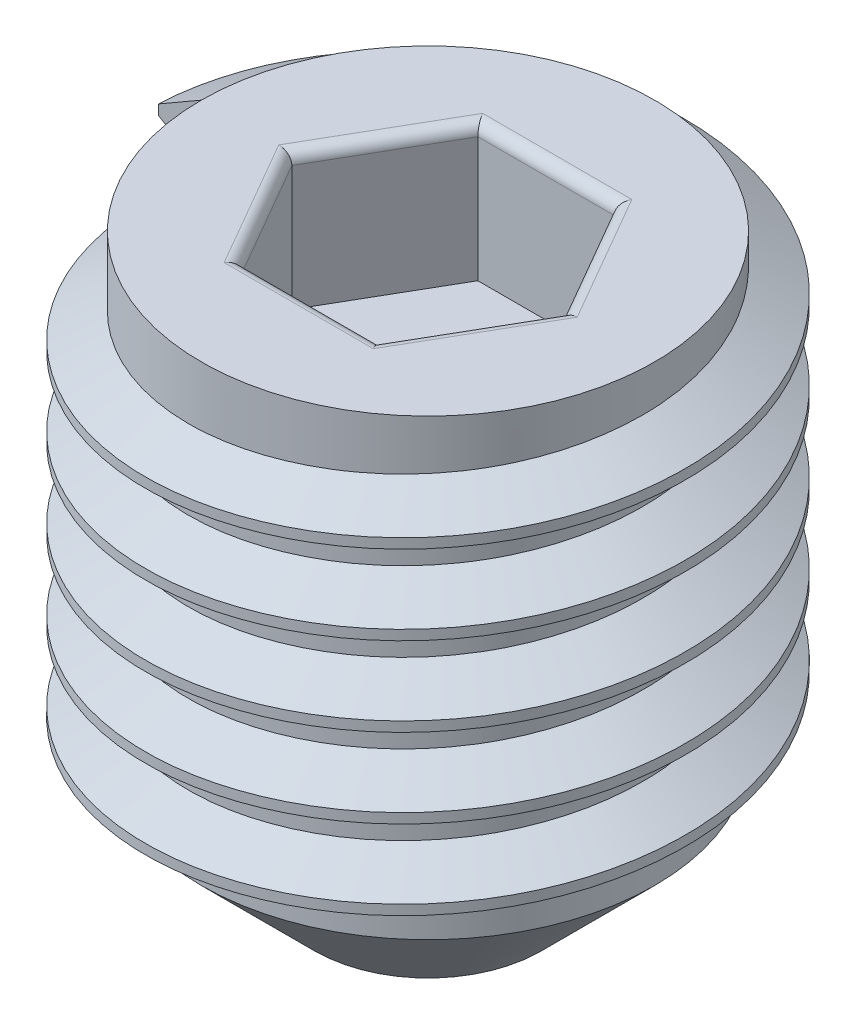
ISO-10303-21;
HEADER;
FILE_DESCRIPTION(('STEP AP214'),'2;1');
FILE_NAME('part.step','',(''),(''),'','','');
FILE_SCHEMA(('AUTOMOTIVE_DESIGN { 1 0 10303 214 1 1 1 1 }'));
ENDSEC;
DATA;
#1=APPLICATION_CONTEXT('core data for automotive mechanical design processes');
#2=APPLICATION_PROTOCOL_DEFINITION('international standard','automotive_design',2000,#1);
#3=PRODUCT_CONTEXT('',#1,'mechanical');
#4=PRODUCT('Part','Part','',(#3));
#5=PRODUCT_RELATED_PRODUCT_CATEGORY('part','',(#4));
#6=PRODUCT_DEFINITION_FORMATION('','',#4);
#7=PRODUCT_DEFINITION_CONTEXT('part definition',#1,'design');
#8=PRODUCT_DEFINITION('design','',#6,#7);
#9=PRODUCT_DEFINITION_SHAPE('','',#8);
#10=(LENGTH_UNIT() NAMED_UNIT(*) SI_UNIT(.MILLI.,.METRE.));
#11=(NAMED_UNIT(*) PLANE_ANGLE_UNIT() SI_UNIT($,.RADIAN.));
#12=(NAMED_UNIT(*) SI_UNIT($,.STERADIAN.) SOLID_ANGLE_UNIT());
#13=UNCERTAINTY_MEASURE_WITH_UNIT(LENGTH_MEASURE(1.E-05),#10,'distance_accuracy_value','');
#14=(GEOMETRIC_REPRESENTATION_CONTEXT(3) GLOBAL_UNCERTAINTY_ASSIGNED_CONTEXT((#13)) GLOBAL_UNIT_ASSIGNED_CONTEXT((#10,
#11,#12)) REPRESENTATION_CONTEXT('',''));
#15=CARTESIAN_POINT('',(0.,0.,0.));
#16=DIRECTION('',(0.,0.,1.));
#17=DIRECTION('',(1.,0.,0.));
#18=AXIS2_PLACEMENT_3D('',#15,#16,#17);
#19=CARTESIAN_POINT('',(0.,5.,0.));
#20=DIRECTION('',(0.,-1.,0.));
#21=DIRECTION('',(0.,0.,-1.));
#22=AXIS2_PLACEMENT_3D('',#19,#20,#21);
#23=CYLINDRICAL_SURFACE('',#22,2.);
#24=DIRECTION('',(0.,1.,0.));
#25=VECTOR('',#24,1.);
#26=CARTESIAN_POINT('',(-2.,4.73750000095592,0.));
#27=LINE('',#26,#25);
#28=CARTESIAN_POINT('',(-2.,4.47500000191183,0.));
#29=VERTEX_POINT('',#28);
#30=CARTESIAN_POINT('',(-2.,5.,0.));
#31=VERTEX_POINT('',#30);
#32=EDGE_CURVE('E216',#29,#31,#27,.T.);
#33=ORIENTED_EDGE('',*,*,#32,.F.);
#34=CARTESIAN_POINT('',(-2.,4.47500000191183,0.));
#35=CARTESIAN_POINT('',(-2.,4.4166666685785,-1.15470053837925));
#36=CARTESIAN_POINT('',(-1.,4.35833333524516,-1.73205080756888));
#37=CARTESIAN_POINT('',(0.,4.30000000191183,-2.3094010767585));
#38=CARTESIAN_POINT('',(1.,4.2416666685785,-1.73205080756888));
#39=CARTESIAN_POINT('',(2.,4.18333333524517,-1.15470053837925));
#40=CARTESIAN_POINT('',(2.,4.12500000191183,0.));
#41=CARTESIAN_POINT('',(2.,4.0666666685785,1.15470053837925));
#42=CARTESIAN_POINT('',(1.,4.00833333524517,1.73205080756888));
#43=CARTESIAN_POINT('',(0.,3.95000000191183,2.3094010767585));
#44=CARTESIAN_POINT('',(-0.999999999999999,3.8916666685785,1.73205080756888));
#45=CARTESIAN_POINT('',(-2.,3.83333333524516,1.15470053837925));
#46=CARTESIAN_POINT('',(-2.,3.77500000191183,0.));
#47=CARTESIAN_POINT('',(-2.,3.7166666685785,-1.15470053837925));
#48=CARTESIAN_POINT('',(-1.,3.65833333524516,-1.73205080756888));
#49=CARTESIAN_POINT('',(0.,3.60000000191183,-2.3094010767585));
#50=CARTESIAN_POINT('',(1.,3.5416666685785,-1.73205080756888));
#51=CARTESIAN_POINT('',(2.,3.48333333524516,-1.15470053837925));
#52=CARTESIAN_POINT('',(2.,3.42500000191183,0.));
#53=CARTESIAN_POINT('',(2.,3.3666666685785,1.15470053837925));
#54=CARTESIAN_POINT('',(1.,3.30833333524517,1.73205080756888));
#55=CARTESIAN_POINT('',(0.,3.25000000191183,2.3094010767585));
#56=CARTESIAN_POINT('',(-0.999999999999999,3.1916666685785,1.73205080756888));
#57=CARTESIAN_POINT('',(-2.,3.13333333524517,1.15470053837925));
#58=CARTESIAN_POINT('',(-2.,3.07500000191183,0.));
#59=CARTESIAN_POINT('',(-2.,3.0166666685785,-1.15470053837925));
#60=CARTESIAN_POINT('',(-1.,2.95833333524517,-1.73205080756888));
#61=CARTESIAN_POINT('',(0.,2.90000000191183,-2.3094010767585));
#62=CARTESIAN_POINT('',(1.,2.8416666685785,-1.73205080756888));
#63=CARTESIAN_POINT('',(2.,2.78333333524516,-1.15470053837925));
#64=CARTESIAN_POINT('',(2.,2.72500000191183,0.));
#65=CARTESIAN_POINT('',(2.,2.6666666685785,1.15470053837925));
#66=CARTESIAN_POINT('',(1.,2.60833333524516,1.73205080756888));
#67=CARTESIAN_POINT('',(0.,2.55000000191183,2.3094010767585));
#68=CARTESIAN_POINT('',(-0.999999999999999,2.4916666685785,1.73205080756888));
#69=CARTESIAN_POINT('',(-2.,2.43333333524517,1.15470053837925));
#70=CARTESIAN_POINT('',(-2.,2.37500000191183,0.));
#71=CARTESIAN_POINT('',(-2.,2.3166666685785,-1.15470053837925));
#72=CARTESIAN_POINT('',(-1.,2.25833333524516,-1.73205080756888));
#73=CARTESIAN_POINT('',(0.,2.20000000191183,-2.3094010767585));
#74=CARTESIAN_POINT('',(1.,2.1416666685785,-1.73205080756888));
#75=CARTESIAN_POINT('',(2.,2.08333333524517,-1.15470053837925));
#76=CARTESIAN_POINT('',(2.,2.02500000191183,0.));
#77=CARTESIAN_POINT('',(2.,1.9666666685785,1.15470053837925));
#78=CARTESIAN_POINT('',(1.,1.90833333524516,1.73205080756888));
#79=CARTESIAN_POINT('',(0.,1.85000000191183,2.3094010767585));
#80=CARTESIAN_POINT('',(-0.999999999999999,1.7916666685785,1.73205080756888));
#81=CARTESIAN_POINT('',(-2.,1.73333333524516,1.15470053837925));
#82=CARTESIAN_POINT('',(-2.,1.67500000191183,0.));
#83=CARTESIAN_POINT('',(-2.,1.6166666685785,-1.15470053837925));
#84=CARTESIAN_POINT('',(-1.,1.55833333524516,-1.73205080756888));
#85=CARTESIAN_POINT('',(0.,1.50000000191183,-2.3094010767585));
#86=CARTESIAN_POINT('',(1.,1.4416666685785,-1.73205080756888));
#87=CARTESIAN_POINT('',(2.,1.38333333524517,-1.15470053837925));
#88=CARTESIAN_POINT('',(2.,1.32500000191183,0.));
#89=CARTESIAN_POINT('',(2.,1.2666666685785,1.15470053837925));
#90=CARTESIAN_POINT('',(1.,1.20833333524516,1.73205080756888));
#91=CARTESIAN_POINT('',(0.,1.15000000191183,2.3094010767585));
#92=CARTESIAN_POINT('',(-0.999999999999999,1.0916666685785,1.73205080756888));
#93=CARTESIAN_POINT('',(-2.,1.03333333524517,1.15470053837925));
#94=CARTESIAN_POINT('',(-2.,0.975000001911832,0.));
#95=(BOUNDED_CURVE() B_SPLINE_CURVE(2,(#34,#35,#36,#37,#38,#39,#40,#41,#42,#43,#44,#45,#46,#47,
#48,#49,#50,#51,#52,#53,#54,#55,#56,#57,#58,#59,#60,#61,#62,#63,#64,#65,#66,#67,#68,#69,#70,#71,
#72,#73,#74,#75,#76,#77,#78,#79,#80,#81,#82,#83,#84,#85,#86,#87,#88,#89,#90,#91,#92,#93,#94),
.UNSPECIFIED.,.F.,.F.) B_SPLINE_CURVE_WITH_KNOTS((3,2,2,2,2,2,2,2,2,2,2,2,2,2,2,2,2,2,2,2,2,2,2,
2,2,2,2,2,2,2,3),(0.,0.0333333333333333,0.0666666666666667,0.1,0.133333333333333,
0.166666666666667,0.2,0.233333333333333,0.266666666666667,0.3,0.333333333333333,
0.366666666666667,0.4,0.433333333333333,0.466666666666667,0.5,0.533333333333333,
0.566666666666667,0.6,0.633333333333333,0.666666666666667,0.7,0.733333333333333,
0.766666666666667,0.8,0.833333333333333,0.866666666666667,0.9,0.933333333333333,
0.966666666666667,1.),
.UNSPECIFIED.) CURVE() GEOMETRIC_REPRESENTATION_ITEM() RATIONAL_B_SPLINE_CURVE((1.,
0.866025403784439,1.,0.866025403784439,1.,0.866025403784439,1.,0.866025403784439,1.,
0.866025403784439,1.,0.866025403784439,1.,0.866025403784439,1.,0.866025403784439,1.,
0.866025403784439,1.,0.866025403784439,1.,0.866025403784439,1.,0.866025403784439,1.,
0.866025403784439,1.,0.866025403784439,1.,0.866025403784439,1.,0.866025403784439,1.,
0.866025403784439,1.,0.866025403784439,1.,0.866025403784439,1.,0.866025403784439,1.,
0.866025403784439,1.,0.866025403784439,1.,0.866025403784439,1.,0.866025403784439,1.,
0.866025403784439,1.,0.866025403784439,1.,0.866025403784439,1.,0.866025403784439,1.,
0.866025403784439,1.,0.866025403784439,1.)) REPRESENTATION_ITEM(''));
#96=CARTESIAN_POINT('',(-1.9455642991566,1.,0.463443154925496));
#97=VERTEX_POINT('',#96);
#98=EDGE_CURVE('E200',#29,#97,#95,.T.);
#99=ORIENTED_EDGE('',*,*,#98,.T.);
#100=CARTESIAN_POINT('',(0.,1.,0.));
#101=DIRECTION('',(0.,1.,0.));
#102=DIRECTION('',(0.,0.,1.));
#103=AXIS2_PLACEMENT_3D('',#100,#101,#102);
#104=CIRCLE('',#103,2.);
#105=CARTESIAN_POINT('',(-2.,1.,0.));
#106=VERTEX_POINT('',#105);
#107=EDGE_CURVE('E273',#97,#106,#104,.T.);
#108=ORIENTED_EDGE('',*,*,#107,.T.);
#109=DIRECTION('',(0.,-1.,0.));
#110=VECTOR('',#109,1.);
#111=CARTESIAN_POINT('',(-2.,1.23750000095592,0.));
#112=LINE('',#111,#110);
#113=CARTESIAN_POINT('',(-2.,1.5,0.));
#114=VERTEX_POINT('',#113);
#115=EDGE_CURVE('E257',#114,#106,#112,.T.);
#116=ORIENTED_EDGE('',*,*,#115,.F.);
#117=CARTESIAN_POINT('',(-2.,5.,0.));
#118=CARTESIAN_POINT('',(-2.,4.94166666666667,-1.15470053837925));
#119=CARTESIAN_POINT('',(-1.,4.88333333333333,-1.73205080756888));
#120=CARTESIAN_POINT('',(0.,4.825,-2.3094010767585));
#121=CARTESIAN_POINT('',(1.,4.76666666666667,-1.73205080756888));
#122=CARTESIAN_POINT('',(2.,4.70833333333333,-1.15470053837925));
#123=CARTESIAN_POINT('',(2.,4.65,0.));
#124=CARTESIAN_POINT('',(2.,4.59166666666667,1.15470053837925));
#125=CARTESIAN_POINT('',(1.,4.53333333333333,1.73205080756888));
#126=CARTESIAN_POINT('',(0.,4.475,2.3094010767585));
#127=CARTESIAN_POINT('',(-0.999999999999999,4.41666666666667,1.73205080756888));
#128=CARTESIAN_POINT('',(-2.,4.35833333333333,1.15470053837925));
#129=CARTESIAN_POINT('',(-2.,4.3,0.));
#130=CARTESIAN_POINT('',(-2.,4.24166666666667,-1.15470053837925));
#131=CARTESIAN_POINT('',(-1.,4.18333333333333,-1.73205080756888));
#132=CARTESIAN_POINT('',(0.,4.125,-2.3094010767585));
#133=CARTESIAN_POINT('',(1.,4.06666666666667,-1.73205080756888));
#134=CARTESIAN_POINT('',(2.,4.00833333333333,-1.15470053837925));
#135=CARTESIAN_POINT('',(2.,3.95,0.));
#136=CARTESIAN_POINT('',(2.,3.89166666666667,1.15470053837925));
#137=CARTESIAN_POINT('',(1.,3.83333333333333,1.73205080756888));
#138=CARTESIAN_POINT('',(0.,3.775,2.3094010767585));
#139=CARTESIAN_POINT('',(-0.999999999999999,3.71666666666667,1.73205080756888));
#140=CARTESIAN_POINT('',(-2.,3.65833333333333,1.15470053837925));
#141=CARTESIAN_POINT('',(-2.,3.6,0.));
#142=CARTESIAN_POINT('',(-2.,3.54166666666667,-1.15470053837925));
#143=CARTESIAN_POINT('',(-1.,3.48333333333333,-1.73205080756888));
#144=CARTESIAN_POINT('',(0.,3.425,-2.3094010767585));
#145=CARTESIAN_POINT('',(1.,3.36666666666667,-1.73205080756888));
#146=CARTESIAN_POINT('',(2.,3.30833333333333,-1.15470053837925));
#147=CARTESIAN_POINT('',(2.,3.25,0.));
#148=CARTESIAN_POINT('',(2.,3.19166666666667,1.15470053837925));
#149=CARTESIAN_POINT('',(1.,3.13333333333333,1.73205080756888));
#150=CARTESIAN_POINT('',(0.,3.075,2.3094010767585));
#151=CARTESIAN_POINT('',(-0.999999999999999,3.01666666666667,1.73205080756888));
#152=CARTESIAN_POINT('',(-2.,2.95833333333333,1.15470053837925));
#153=CARTESIAN_POINT('',(-2.,2.9,0.));
#154=CARTESIAN_POINT('',(-2.,2.84166666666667,-1.15470053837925));
#155=CARTESIAN_POINT('',(-1.,2.78333333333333,-1.73205080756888));
#156=CARTESIAN_POINT('',(0.,2.725,-2.3094010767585));
#157=CARTESIAN_POINT('',(1.,2.66666666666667,-1.73205080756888));
#158=CARTESIAN_POINT('',(2.,2.60833333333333,-1.15470053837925));
#159=CARTESIAN_POINT('',(2.,2.55,0.));
#160=CARTESIAN_POINT('',(2.,2.49166666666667,1.15470053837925));
#161=CARTESIAN_POINT('',(1.,2.43333333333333,1.73205080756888));
#162=CARTESIAN_POINT('',(0.,2.375,2.3094010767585));
#163=CARTESIAN_POINT('',(-0.999999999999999,2.31666666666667,1.73205080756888));
#164=CARTESIAN_POINT('',(-2.,2.25833333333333,1.15470053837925));
#165=CARTESIAN_POINT('',(-2.,2.2,0.));
#166=CARTESIAN_POINT('',(-2.,2.14166666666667,-1.15470053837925));
#167=CARTESIAN_POINT('',(-1.,2.08333333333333,-1.73205080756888));
#168=CARTESIAN_POINT('',(0.,2.025,-2.3094010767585));
#169=CARTESIAN_POINT('',(1.,1.96666666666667,-1.73205080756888));
#170=CARTESIAN_POINT('',(2.,1.90833333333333,-1.15470053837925));
#171=CARTESIAN_POINT('',(2.,1.85,0.));
#172=CARTESIAN_POINT('',(2.,1.79166666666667,1.15470053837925));
#173=CARTESIAN_POINT('',(1.,1.73333333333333,1.73205080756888));
#174=CARTESIAN_POINT('',(0.,1.675,2.3094010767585));
#175=CARTESIAN_POINT('',(-0.999999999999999,1.61666666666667,1.73205080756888));
#176=CARTESIAN_POINT('',(-2.,1.55833333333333,1.15470053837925));
#177=CARTESIAN_POINT('',(-2.,1.5,0.));
#178=(BOUNDED_CURVE() B_SPLINE_CURVE(2,(#117,#118,#119,#120,#121,#122,#123,#124,#125,#126,#127,
#128,#129,#130,#131,#132,#133,#134,#135,#136,#137,#138,#139,#140,#141,#142,#143,#144,#145,#146,
#147,#148,#149,#150,#151,#152,#153,#154,#155,#156,#157,#158,#159,#160,#161,#162,#163,#164,#165,
#166,#167,#168,#169,#170,#171,#172,#173,#174,#175,#176,#177),.UNSPECIFIED.,.F.,
.F.) B_SPLINE_CURVE_WITH_KNOTS((3,2,2,2,2,2,2,2,2,2,2,2,2,2,2,2,2,2,2,2,2,2,2,2,2,2,2,2,2,2,3),
(0.,0.0333333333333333,0.0666666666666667,0.1,0.133333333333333,0.166666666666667,0.2,
0.233333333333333,0.266666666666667,0.3,0.333333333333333,0.366666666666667,0.4,
0.433333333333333,0.466666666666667,0.5,0.533333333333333,0.566666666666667,0.6,
0.633333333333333,0.666666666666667,0.7,0.733333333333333,0.766666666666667,0.8,
0.833333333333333,0.866666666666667,0.9,0.933333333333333,0.966666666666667,1.),
.UNSPECIFIED.) CURVE() GEOMETRIC_REPRESENTATION_ITEM() RATIONAL_B_SPLINE_CURVE((1.,
0.866025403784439,1.,0.866025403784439,1.,0.866025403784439,1.,0.866025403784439,1.,
0.866025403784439,1.,0.866025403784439,1.,0.866025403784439,1.,0.866025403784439,1.,
0.866025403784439,1.,0.866025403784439,1.,0.866025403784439,1.,0.866025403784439,1.,
0.866025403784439,1.,0.866025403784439,1.,0.866025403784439,1.,0.866025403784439,1.,
0.866025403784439,1.,0.866025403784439,1.,0.866025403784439,1.,0.866025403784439,1.,
0.866025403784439,1.,0.866025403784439,1.,0.866025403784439,1.,0.866025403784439,1.,
0.866025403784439,1.,0.866025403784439,1.,0.866025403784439,1.,0.866025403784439,1.,
0.866025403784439,1.,0.866025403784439,1.)) REPRESENTATION_ITEM(''));
#179=EDGE_CURVE('E217',#31,#114,#178,.T.);
#180=ORIENTED_EDGE('',*,*,#179,.F.);
#181=CARTESIAN_POINT('',(0.,5.,0.));
#182=DIRECTION('',(0.,1.,0.));
#183=DIRECTION('',(0.,0.,1.));
#184=AXIS2_PLACEMENT_3D('',#181,#182,#183);
#185=CIRCLE('',#184,2.);
#186=EDGE_CURVE('E247',#31,#31,#185,.T.);
#187=ORIENTED_EDGE('',*,*,#186,.F.);
#188=EDGE_LOOP('',(#33,#99,#108,#116,#180,#187));
#189=FACE_BOUND('',#188,.T.);
#190=ADVANCED_FACE('F41',(#189),#23,.T.);
#191=CARTESIAN_POINT('',(0.,5.,0.));
#192=DIRECTION('',(0.,1.,0.));
#193=DIRECTION('',(0.,0.,1.));
#194=AXIS2_PLACEMENT_3D('',#191,#192,#193);
#195=PLANE('',#194);
#196=DIRECTION('',(0.5,0.,-0.866025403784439));
#197=VECTOR('',#196,1.);
#198=CARTESIAN_POINT('',(0.687046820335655,5.,1.09));
#199=LINE('',#198,#197);
#200=CARTESIAN_POINT('',(1.31635861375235,5.,0.));
#201=VERTEX_POINT('',#200);
#202=CARTESIAN_POINT('',(0.658179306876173,5.,1.14));
#203=VERTEX_POINT('',#202);
#204=EDGE_CURVE('E286',#201,#203,#199,.F.);
#205=ORIENTED_EDGE('',*,*,#204,.T.);
#206=DIRECTION('',(1.,0.,0.));
#207=VECTOR('',#206,1.);
#208=CARTESIAN_POINT('',(-0.600444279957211,5.,1.14));
#209=LINE('',#208,#207);
#210=CARTESIAN_POINT('',(-0.658179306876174,5.,1.14));
#211=VERTEX_POINT('',#210);
#212=EDGE_CURVE('E301',#203,#211,#209,.F.);
#213=ORIENTED_EDGE('',*,*,#212,.T.);
#214=DIRECTION('',(0.5,0.,0.866025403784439));
#215=VECTOR('',#214,1.);
#216=CARTESIAN_POINT('',(-1.28749110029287,5.,0.05));
#217=LINE('',#216,#215);
#218=CARTESIAN_POINT('',(-1.31635861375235,5.,0.));
#219=VERTEX_POINT('',#218);
#220=EDGE_CURVE('E298',#211,#219,#217,.F.);
#221=ORIENTED_EDGE('',*,*,#220,.T.);
#222=DIRECTION('',(-0.5,0.,0.866025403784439));
#223=VECTOR('',#222,1.);
#224=CARTESIAN_POINT('',(-0.687046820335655,5.,-1.09));
#225=LINE('',#224,#223);
#226=CARTESIAN_POINT('',(-0.658179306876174,5.,-1.14));
#227=VERTEX_POINT('',#226);
#228=EDGE_CURVE('E295',#219,#227,#225,.F.);
#229=ORIENTED_EDGE('',*,*,#228,.T.);
#230=DIRECTION('',(-1.,0.,0.));
#231=VECTOR('',#230,1.);
#232=CARTESIAN_POINT('',(0.600444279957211,5.,-1.14));
#233=LINE('',#232,#231);
#234=CARTESIAN_POINT('',(0.658179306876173,5.,-1.14));
#235=VERTEX_POINT('',#234);
#236=EDGE_CURVE('E292',#227,#235,#233,.F.);
#237=ORIENTED_EDGE('',*,*,#236,.T.);
#238=DIRECTION('',(-0.5,0.,-0.866025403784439));
#239=VECTOR('',#238,1.);
#240=CARTESIAN_POINT('',(1.28749110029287,5.,-0.0500000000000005));
#241=LINE('',#240,#239);
#242=EDGE_CURVE('E289',#235,#201,#241,.F.);
#243=ORIENTED_EDGE('',*,*,#242,.T.);
#244=EDGE_LOOP('',(#205,#213,#221,#229,#237,#243));
#245=FACE_BOUND('',#244,.T.);
#246=ORIENTED_EDGE('',*,*,#186,.T.);
#247=EDGE_LOOP('',(#246));
#248=FACE_BOUND('',#247,.T.);
#249=ADVANCED_FACE('F364',(#245,#248),#195,.T.);
#250=CARTESIAN_POINT('',(0.,0.,0.));
#251=DIRECTION('',(0.,1.,0.));
#252=DIRECTION('',(0.,0.,1.));
#253=AXIS2_PLACEMENT_3D('',#250,#251,#252);
#254=PLANE('',#253);
#255=CARTESIAN_POINT('',(0.,0.,0.));
#256=DIRECTION('',(0.,1.,0.));
#257=DIRECTION('',(0.,0.,1.));
#258=AXIS2_PLACEMENT_3D('',#255,#256,#257);
#259=CIRCLE('',#258,0.999999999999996);
#260=CARTESIAN_POINT('',(0.,0.,0.999999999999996));
#261=VERTEX_POINT('',#260);
#262=EDGE_CURVE('E278',#261,#261,#259,.F.);
#263=ORIENTED_EDGE('',*,*,#262,.T.);
#264=EDGE_LOOP('',(#263));
#265=FACE_BOUND('',#264,.T.);
#266=ADVANCED_FACE('F370',(#265),#254,.F.);
#267=CARTESIAN_POINT('',(0.,1.,0.));
#268=DIRECTION('',(0.,1.,0.));
#269=DIRECTION('',(0.,0.,1.));
#270=AXIS2_PLACEMENT_3D('',#267,#268,#269);
#271=CONICAL_SURFACE('',#270,2.,0.78539816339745);
#272=ORIENTED_EDGE('',*,*,#262,.F.);
#273=EDGE_LOOP('',(#272));
#274=FACE_BOUND('',#273,.T.);
#275=EDGE_CURVE('E274',#106,#97,#104,.T.);
#276=ORIENTED_EDGE('',*,*,#275,.F.);
#277=ORIENTED_EDGE('',*,*,#107,.F.);
#278=EDGE_LOOP('',(#276,#277));
#279=FACE_BOUND('',#278,.T.);
#280=ADVANCED_FACE('F376',(#274,#279),#271,.T.);
#281=CARTESIAN_POINT('',(-2.3788861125,4.73750000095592,0.));
#282=DIRECTION('',(0.,0.,1.));
#283=DIRECTION('',(1.,0.,0.));
#284=AXIS2_PLACEMENT_3D('',#281,#282,#283);
#285=PLANE('',#284);
#286=DIRECTION('',(0.,-1.,0.));
#287=VECTOR('',#286,1.);
#288=CARTESIAN_POINT('',(-2.3788861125,4.73750000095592,0.));
#289=LINE('',#288,#287);
#290=CARTESIAN_POINT('',(-2.3788861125,4.78125000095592,0.));
#291=VERTEX_POINT('',#290);
#292=CARTESIAN_POINT('',(-2.3788861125,4.69375000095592,0.));
#293=VERTEX_POINT('',#292);
#294=EDGE_CURVE('E248',#291,#293,#289,.T.);
#295=ORIENTED_EDGE('',*,*,#294,.T.);
#296=DIRECTION('',(0.86602540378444,-0.499999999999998,0.));
#297=VECTOR('',#296,1.);
#298=CARTESIAN_POINT('',(-2.18944305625,4.58437500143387,0.));
#299=LINE('',#298,#297);
#300=EDGE_CURVE('E186',#293,#29,#299,.T.);
#301=ORIENTED_EDGE('',*,*,#300,.T.);
#302=ORIENTED_EDGE('',*,*,#32,.T.);
#303=DIRECTION('',(-0.86602540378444,-0.499999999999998,0.));
#304=VECTOR('',#303,1.);
#305=CARTESIAN_POINT('',(-2.18944305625,4.89062500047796,0.));
#306=LINE('',#305,#304);
#307=EDGE_CURVE('E238',#31,#291,#306,.T.);
#308=ORIENTED_EDGE('',*,*,#307,.T.);
#309=EDGE_LOOP('',(#295,#301,#302,#308));
#310=FACE_BOUND('',#309,.T.);
#311=ADVANCED_FACE('F381',(#310),#285,.T.);
#312=CARTESIAN_POINT('',(-2.3788861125,1.23750000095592,0.));
#313=DIRECTION('',(0.,0.,-1.));
#314=DIRECTION('',(-1.,0.,0.));
#315=AXIS2_PLACEMENT_3D('',#312,#313,#314);
#316=PLANE('',#315);
#317=DIRECTION('',(0.,1.,0.));
#318=VECTOR('',#317,1.);
#319=CARTESIAN_POINT('',(-2.3788861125,1.23750000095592,0.));
#320=LINE('',#319,#318);
#321=CARTESIAN_POINT('',(-2.3788861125,1.19375000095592,0.));
#322=VERTEX_POINT('',#321);
#323=CARTESIAN_POINT('',(-2.3788861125,1.28125000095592,0.));
#324=VERTEX_POINT('',#323);
#325=EDGE_CURVE('E239',#322,#324,#320,.T.);
#326=ORIENTED_EDGE('',*,*,#325,.T.);
#327=DIRECTION('',(0.86602540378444,0.499999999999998,0.));
#328=VECTOR('',#327,1.);
#329=CARTESIAN_POINT('',(-2.18944305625,1.39062500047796,0.));
#330=LINE('',#329,#328);
#331=EDGE_CURVE('E237',#324,#114,#330,.T.);
#332=ORIENTED_EDGE('',*,*,#331,.T.);
#333=ORIENTED_EDGE('',*,*,#115,.T.);
#334=CARTESIAN_POINT('',(-2.,0.975000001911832,0.));
#335=VERTEX_POINT('',#334);
#336=EDGE_CURVE('E227',#106,#335,#112,.T.);
#337=ORIENTED_EDGE('',*,*,#336,.T.);
#338=DIRECTION('',(-0.86602540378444,0.499999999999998,0.));
#339=VECTOR('',#338,1.);
#340=CARTESIAN_POINT('',(-2.18944305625,1.08437500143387,0.));
#341=LINE('',#340,#339);
#342=EDGE_CURVE('E264',#335,#322,#341,.T.);
#343=ORIENTED_EDGE('',*,*,#342,.T.);
#344=EDGE_LOOP('',(#326,#332,#333,#337,#343));
#345=FACE_BOUND('',#344,.T.);
#346=ADVANCED_FACE('F434',(#345),#316,.T.);
#347=CARTESIAN_POINT('',(-2.3788861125,4.78125000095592,0.));
#348=CARTESIAN_POINT('',(-2.3788861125,4.72291666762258,-1.37345053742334));
#349=CARTESIAN_POINT('',(-1.18944305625,4.66458333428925,-2.06017580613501));
#350=CARTESIAN_POINT('',(0.,4.60625000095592,-2.74690107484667));
#351=CARTESIAN_POINT('',(1.18944305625,4.54791666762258,-2.06017580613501));
#352=CARTESIAN_POINT('',(2.3788861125,4.48958333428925,-1.37345053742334));
#353=CARTESIAN_POINT('',(2.3788861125,4.43125000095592,0.));
#354=CARTESIAN_POINT('',(2.3788861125,4.37291666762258,1.37345053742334));
#355=CARTESIAN_POINT('',(1.18944305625,4.31458333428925,2.06017580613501));
#356=CARTESIAN_POINT('',(0.,4.25625000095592,2.74690107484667));
#357=CARTESIAN_POINT('',(-1.18944305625,4.19791666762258,2.06017580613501));
#358=CARTESIAN_POINT('',(-2.3788861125,4.13958333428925,1.37345053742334));
#359=CARTESIAN_POINT('',(-2.3788861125,4.08125000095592,0.));
#360=CARTESIAN_POINT('',(-2.3788861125,4.02291666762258,-1.37345053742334));
#361=CARTESIAN_POINT('',(-1.18944305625,3.96458333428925,-2.06017580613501));
#362=CARTESIAN_POINT('',(0.,3.90625000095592,-2.74690107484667));
#363=CARTESIAN_POINT('',(1.18944305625,3.84791666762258,-2.06017580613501));
#364=CARTESIAN_POINT('',(2.3788861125,3.78958333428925,-1.37345053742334));
#365=CARTESIAN_POINT('',(2.3788861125,3.73125000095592,0.));
#366=CARTESIAN_POINT('',(2.3788861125,3.67291666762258,1.37345053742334));
#367=CARTESIAN_POINT('',(1.18944305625,3.61458333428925,2.06017580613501));
#368=CARTESIAN_POINT('',(0.,3.55625000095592,2.74690107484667));
#369=CARTESIAN_POINT('',(-1.18944305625,3.49791666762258,2.06017580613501));
#370=CARTESIAN_POINT('',(-2.3788861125,3.43958333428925,1.37345053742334));
#371=CARTESIAN_POINT('',(-2.3788861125,3.38125000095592,0.));
#372=CARTESIAN_POINT('',(-2.3788861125,3.32291666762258,-1.37345053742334));
#373=CARTESIAN_POINT('',(-1.18944305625,3.26458333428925,-2.06017580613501));
#374=CARTESIAN_POINT('',(0.,3.20625000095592,-2.74690107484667));
#375=CARTESIAN_POINT('',(1.18944305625,3.14791666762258,-2.06017580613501));
#376=CARTESIAN_POINT('',(2.3788861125,3.08958333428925,-1.37345053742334));
#377=CARTESIAN_POINT('',(2.3788861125,3.03125000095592,0.));
#378=CARTESIAN_POINT('',(2.3788861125,2.97291666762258,1.37345053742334));
#379=CARTESIAN_POINT('',(1.18944305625,2.91458333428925,2.06017580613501));
#380=CARTESIAN_POINT('',(0.,2.85625000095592,2.74690107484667));
#381=CARTESIAN_POINT('',(-1.18944305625,2.79791666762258,2.06017580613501));
#382=CARTESIAN_POINT('',(-2.3788861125,2.73958333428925,1.37345053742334));
#383=CARTESIAN_POINT('',(-2.3788861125,2.68125000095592,0.));
#384=CARTESIAN_POINT('',(-2.3788861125,2.62291666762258,-1.37345053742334));
#385=CARTESIAN_POINT('',(-1.18944305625,2.56458333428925,-2.06017580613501));
#386=CARTESIAN_POINT('',(0.,2.50625000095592,-2.74690107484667));
#387=CARTESIAN_POINT('',(1.18944305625,2.44791666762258,-2.06017580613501));
#388=CARTESIAN_POINT('',(2.3788861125,2.38958333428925,-1.37345053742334));
#389=CARTESIAN_POINT('',(2.3788861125,2.33125000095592,0.));
#390=CARTESIAN_POINT('',(2.3788861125,2.27291666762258,1.37345053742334));
#391=CARTESIAN_POINT('',(1.18944305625,2.21458333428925,2.06017580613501));
#392=CARTESIAN_POINT('',(0.,2.15625000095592,2.74690107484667));
#393=CARTESIAN_POINT('',(-1.18944305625,2.09791666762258,2.06017580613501));
#394=CARTESIAN_POINT('',(-2.3788861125,2.03958333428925,1.37345053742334));
#395=CARTESIAN_POINT('',(-2.3788861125,1.98125000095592,0.));
#396=CARTESIAN_POINT('',(-2.3788861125,1.92291666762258,-1.37345053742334));
#397=CARTESIAN_POINT('',(-1.18944305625,1.86458333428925,-2.06017580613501));
#398=CARTESIAN_POINT('',(0.,1.80625000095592,-2.74690107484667));
#399=CARTESIAN_POINT('',(1.18944305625,1.74791666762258,-2.06017580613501));
#400=CARTESIAN_POINT('',(2.3788861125,1.68958333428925,-1.37345053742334));
#401=CARTESIAN_POINT('',(2.3788861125,1.63125000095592,0.));
#402=CARTESIAN_POINT('',(2.3788861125,1.57291666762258,1.37345053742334));
#403=CARTESIAN_POINT('',(1.18944305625,1.51458333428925,2.06017580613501));
#404=CARTESIAN_POINT('',(0.,1.45625000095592,2.74690107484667));
#405=CARTESIAN_POINT('',(-1.18944305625,1.39791666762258,2.06017580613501));
#406=CARTESIAN_POINT('',(-2.3788861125,1.33958333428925,1.37345053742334));
#407=CARTESIAN_POINT('',(-2.3788861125,1.28125000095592,0.));
#408=CARTESIAN_POINT('',(-2.3788861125,4.69375000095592,0.));
#409=CARTESIAN_POINT('',(-2.3788861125,4.63541666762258,-1.37345053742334));
#410=CARTESIAN_POINT('',(-1.18944305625,4.57708333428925,-2.06017580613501));
#411=CARTESIAN_POINT('',(0.,4.51875000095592,-2.74690107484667));
#412=CARTESIAN_POINT('',(1.18944305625,4.46041666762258,-2.06017580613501));
#413=CARTESIAN_POINT('',(2.3788861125,4.40208333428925,-1.37345053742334));
#414=CARTESIAN_POINT('',(2.3788861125,4.34375000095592,0.));
#415=CARTESIAN_POINT('',(2.3788861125,4.28541666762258,1.37345053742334));
#416=CARTESIAN_POINT('',(1.18944305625,4.22708333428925,2.06017580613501));
#417=CARTESIAN_POINT('',(0.,4.16875000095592,2.74690107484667));
#418=CARTESIAN_POINT('',(-1.18944305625,4.11041666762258,2.06017580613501));
#419=CARTESIAN_POINT('',(-2.3788861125,4.05208333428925,1.37345053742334));
#420=CARTESIAN_POINT('',(-2.3788861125,3.99375000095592,0.));
#421=CARTESIAN_POINT('',(-2.3788861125,3.93541666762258,-1.37345053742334));
#422=CARTESIAN_POINT('',(-1.18944305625,3.87708333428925,-2.06017580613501));
#423=CARTESIAN_POINT('',(0.,3.81875000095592,-2.74690107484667));
#424=CARTESIAN_POINT('',(1.18944305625,3.76041666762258,-2.06017580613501));
#425=CARTESIAN_POINT('',(2.3788861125,3.70208333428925,-1.37345053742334));
#426=CARTESIAN_POINT('',(2.3788861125,3.64375000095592,0.));
#427=CARTESIAN_POINT('',(2.3788861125,3.58541666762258,1.37345053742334));
#428=CARTESIAN_POINT('',(1.18944305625,3.52708333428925,2.06017580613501));
#429=CARTESIAN_POINT('',(0.,3.46875000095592,2.74690107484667));
#430=CARTESIAN_POINT('',(-1.18944305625,3.41041666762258,2.06017580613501));
#431=CARTESIAN_POINT('',(-2.3788861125,3.35208333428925,1.37345053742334));
#432=CARTESIAN_POINT('',(-2.3788861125,3.29375000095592,0.));
#433=CARTESIAN_POINT('',(-2.3788861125,3.23541666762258,-1.37345053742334));
#434=CARTESIAN_POINT('',(-1.18944305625,3.17708333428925,-2.06017580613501));
#435=CARTESIAN_POINT('',(0.,3.11875000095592,-2.74690107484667));
#436=CARTESIAN_POINT('',(1.18944305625,3.06041666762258,-2.06017580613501));
#437=CARTESIAN_POINT('',(2.3788861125,3.00208333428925,-1.37345053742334));
#438=CARTESIAN_POINT('',(2.3788861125,2.94375000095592,0.));
#439=CARTESIAN_POINT('',(2.3788861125,2.88541666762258,1.37345053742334));
#440=CARTESIAN_POINT('',(1.18944305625,2.82708333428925,2.06017580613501));
#441=CARTESIAN_POINT('',(0.,2.76875000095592,2.74690107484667));
#442=CARTESIAN_POINT('',(-1.18944305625,2.71041666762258,2.06017580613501));
#443=CARTESIAN_POINT('',(-2.3788861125,2.65208333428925,1.37345053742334));
#444=CARTESIAN_POINT('',(-2.3788861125,2.59375000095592,0.));
#445=CARTESIAN_POINT('',(-2.3788861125,2.53541666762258,-1.37345053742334));
#446=CARTESIAN_POINT('',(-1.18944305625,2.47708333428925,-2.06017580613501));
#447=CARTESIAN_POINT('',(0.,2.41875000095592,-2.74690107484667));
#448=CARTESIAN_POINT('',(1.18944305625,2.36041666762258,-2.06017580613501));
#449=CARTESIAN_POINT('',(2.3788861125,2.30208333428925,-1.37345053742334));
#450=CARTESIAN_POINT('',(2.3788861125,2.24375000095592,0.));
#451=CARTESIAN_POINT('',(2.3788861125,2.18541666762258,1.37345053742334));
#452=CARTESIAN_POINT('',(1.18944305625,2.12708333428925,2.06017580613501));
#453=CARTESIAN_POINT('',(0.,2.06875000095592,2.74690107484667));
#454=CARTESIAN_POINT('',(-1.18944305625,2.01041666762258,2.06017580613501));
#455=CARTESIAN_POINT('',(-2.3788861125,1.95208333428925,1.37345053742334));
#456=CARTESIAN_POINT('',(-2.3788861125,1.89375000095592,0.));
#457=CARTESIAN_POINT('',(-2.3788861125,1.83541666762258,-1.37345053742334));
#458=CARTESIAN_POINT('',(-1.18944305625,1.77708333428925,-2.06017580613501));
#459=CARTESIAN_POINT('',(0.,1.71875000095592,-2.74690107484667));
#460=CARTESIAN_POINT('',(1.18944305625,1.66041666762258,-2.06017580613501));
#461=CARTESIAN_POINT('',(2.3788861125,1.60208333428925,-1.37345053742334));
#462=CARTESIAN_POINT('',(2.3788861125,1.54375000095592,0.));
#463=CARTESIAN_POINT('',(2.3788861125,1.48541666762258,1.37345053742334));
#464=CARTESIAN_POINT('',(1.18944305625,1.42708333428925,2.06017580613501));
#465=CARTESIAN_POINT('',(0.,1.36875000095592,2.74690107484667));
#466=CARTESIAN_POINT('',(-1.18944305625,1.31041666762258,2.06017580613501));
#467=CARTESIAN_POINT('',(-2.3788861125,1.25208333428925,1.37345053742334));
#468=CARTESIAN_POINT('',(-2.3788861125,1.19375000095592,0.));
#469=(BOUNDED_SURFACE() B_SPLINE_SURFACE(1,2,((#347,#348,#349,#350,#351,#352,#353,#354,#355,
#356,#357,#358,#359,#360,#361,#362,#363,#364,#365,#366,#367,#368,#369,#370,#371,#372,#373,#374,
#375,#376,#377,#378,#379,#380,#381,#382,#383,#384,#385,#386,#387,#388,#389,#390,#391,#392,#393,
#394,#395,#396,#397,#398,#399,#400,#401,#402,#403,#404,#405,#406,#407),(#408,#409,#410,#411,
#412,#413,#414,#415,#416,#417,#418,#419,#420,#421,#422,#423,#424,#425,#426,#427,#428,#429,#430,
#431,#432,#433,#434,#435,#436,#437,#438,#439,#440,#441,#442,#443,#444,#445,#446,#447,#448,#449,
#450,#451,#452,#453,#454,#455,#456,#457,#458,#459,#460,#461,#462,#463,#464,#465,#466,#467,
#468)),.UNSPECIFIED.,.F.,.F.,.F.) B_SPLINE_SURFACE_WITH_KNOTS((2,2),(3,2,2,2,2,2,2,2,2,2,2,2,2,
2,2,2,2,2,2,2,2,2,2,2,2,2,2,2,2,2,3),(0.,1.),(0.,0.0333333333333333,0.0666666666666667,0.1,
0.133333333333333,0.166666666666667,0.2,0.233333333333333,0.266666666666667,0.3,
0.333333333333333,0.366666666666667,0.4,0.433333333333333,0.466666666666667,0.5,
0.533333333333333,0.566666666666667,0.6,0.633333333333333,0.666666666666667,0.7,
0.733333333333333,0.766666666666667,0.8,0.833333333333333,0.866666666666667,0.9,
0.933333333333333,0.966666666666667,1.),
.UNSPECIFIED.) GEOMETRIC_REPRESENTATION_ITEM() RATIONAL_B_SPLINE_SURFACE(((1.,0.866025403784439,
1.,0.866025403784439,1.,0.866025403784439,1.,0.866025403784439,1.,0.866025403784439,1.,
0.866025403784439,1.,0.866025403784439,1.,0.866025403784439,1.,0.866025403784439,1.,
0.866025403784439,1.,0.866025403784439,1.,0.866025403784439,1.,0.866025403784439,1.,
0.866025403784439,1.,0.866025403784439,1.,0.866025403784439,1.,0.866025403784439,1.,
0.866025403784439,1.,0.866025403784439,1.,0.866025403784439,1.,0.866025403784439,1.,
0.866025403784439,1.,0.866025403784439,1.,0.866025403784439,1.,0.866025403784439,1.,
0.866025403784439,1.,0.866025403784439,1.,0.866025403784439,1.,0.866025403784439,1.,
0.866025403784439,1.),(1.,0.866025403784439,1.,0.866025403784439,1.,0.866025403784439,1.,
0.866025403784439,1.,0.866025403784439,1.,0.866025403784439,1.,0.866025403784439,1.,
0.866025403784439,1.,0.866025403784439,1.,0.866025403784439,1.,0.866025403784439,1.,
0.866025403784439,1.,0.866025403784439,1.,0.866025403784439,1.,0.866025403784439,1.,
0.866025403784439,1.,0.866025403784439,1.,0.866025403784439,1.,0.866025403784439,1.,
0.866025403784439,1.,0.866025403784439,1.,0.866025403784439,1.,0.866025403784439,1.,
0.866025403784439,1.,0.866025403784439,1.,0.866025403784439,1.,0.866025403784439,1.,
0.866025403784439,1.,0.866025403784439,1.,0.866025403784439,1.))) REPRESENTATION_ITEM('') SURFACE());
#470=CARTESIAN_POINT('',(-2.3788861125,4.78125000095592,0.));
#471=CARTESIAN_POINT('',(-2.3788861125,4.72291666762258,-1.37345053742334));
#472=CARTESIAN_POINT('',(-1.18944305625,4.66458333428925,-2.06017580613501));
#473=CARTESIAN_POINT('',(0.,4.60625000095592,-2.74690107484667));
#474=CARTESIAN_POINT('',(1.18944305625,4.54791666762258,-2.06017580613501));
#475=CARTESIAN_POINT('',(2.3788861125,4.48958333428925,-1.37345053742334));
#476=CARTESIAN_POINT('',(2.3788861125,4.43125000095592,0.));
#477=CARTESIAN_POINT('',(2.3788861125,4.37291666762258,1.37345053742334));
#478=CARTESIAN_POINT('',(1.18944305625,4.31458333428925,2.06017580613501));
#479=CARTESIAN_POINT('',(0.,4.25625000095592,2.74690107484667));
#480=CARTESIAN_POINT('',(-1.18944305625,4.19791666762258,2.06017580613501));
#481=CARTESIAN_POINT('',(-2.3788861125,4.13958333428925,1.37345053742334));
#482=CARTESIAN_POINT('',(-2.3788861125,4.08125000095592,0.));
#483=CARTESIAN_POINT('',(-2.3788861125,4.02291666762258,-1.37345053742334));
#484=CARTESIAN_POINT('',(-1.18944305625,3.96458333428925,-2.06017580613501));
#485=CARTESIAN_POINT('',(0.,3.90625000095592,-2.74690107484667));
#486=CARTESIAN_POINT('',(1.18944305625,3.84791666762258,-2.06017580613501));
#487=CARTESIAN_POINT('',(2.3788861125,3.78958333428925,-1.37345053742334));
#488=CARTESIAN_POINT('',(2.3788861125,3.73125000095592,0.));
#489=CARTESIAN_POINT('',(2.3788861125,3.67291666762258,1.37345053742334));
#490=CARTESIAN_POINT('',(1.18944305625,3.61458333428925,2.06017580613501));
#491=CARTESIAN_POINT('',(0.,3.55625000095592,2.74690107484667));
#492=CARTESIAN_POINT('',(-1.18944305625,3.49791666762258,2.06017580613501));
#493=CARTESIAN_POINT('',(-2.3788861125,3.43958333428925,1.37345053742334));
#494=CARTESIAN_POINT('',(-2.3788861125,3.38125000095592,0.));
#495=CARTESIAN_POINT('',(-2.3788861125,3.32291666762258,-1.37345053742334));
#496=CARTESIAN_POINT('',(-1.18944305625,3.26458333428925,-2.06017580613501));
#497=CARTESIAN_POINT('',(0.,3.20625000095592,-2.74690107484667));
#498=CARTESIAN_POINT('',(1.18944305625,3.14791666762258,-2.06017580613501));
#499=CARTESIAN_POINT('',(2.3788861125,3.08958333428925,-1.37345053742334));
#500=CARTESIAN_POINT('',(2.3788861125,3.03125000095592,0.));
#501=CARTESIAN_POINT('',(2.3788861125,2.97291666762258,1.37345053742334));
#502=CARTESIAN_POINT('',(1.18944305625,2.91458333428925,2.06017580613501));
#503=CARTESIAN_POINT('',(0.,2.85625000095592,2.74690107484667));
#504=CARTESIAN_POINT('',(-1.18944305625,2.79791666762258,2.06017580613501));
#505=CARTESIAN_POINT('',(-2.3788861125,2.73958333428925,1.37345053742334));
#506=CARTESIAN_POINT('',(-2.3788861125,2.68125000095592,0.));
#507=CARTESIAN_POINT('',(-2.3788861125,2.62291666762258,-1.37345053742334));
#508=CARTESIAN_POINT('',(-1.18944305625,2.56458333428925,-2.06017580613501));
#509=CARTESIAN_POINT('',(0.,2.50625000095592,-2.74690107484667));
#510=CARTESIAN_POINT('',(1.18944305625,2.44791666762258,-2.06017580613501));
#511=CARTESIAN_POINT('',(2.3788861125,2.38958333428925,-1.37345053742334));
#512=CARTESIAN_POINT('',(2.3788861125,2.33125000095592,0.));
#513=CARTESIAN_POINT('',(2.3788861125,2.27291666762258,1.37345053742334));
#514=CARTESIAN_POINT('',(1.18944305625,2.21458333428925,2.06017580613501));
#515=CARTESIAN_POINT('',(0.,2.15625000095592,2.74690107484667));
#516=CARTESIAN_POINT('',(-1.18944305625,2.09791666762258,2.06017580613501));
#517=CARTESIAN_POINT('',(-2.3788861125,2.03958333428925,1.37345053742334));
#518=CARTESIAN_POINT('',(-2.3788861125,1.98125000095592,0.));
#519=CARTESIAN_POINT('',(-2.3788861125,1.92291666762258,-1.37345053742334));
#520=CARTESIAN_POINT('',(-1.18944305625,1.86458333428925,-2.06017580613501));
#521=CARTESIAN_POINT('',(0.,1.80625000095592,-2.74690107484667));
#522=CARTESIAN_POINT('',(1.18944305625,1.74791666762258,-2.06017580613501));
#523=CARTESIAN_POINT('',(2.3788861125,1.68958333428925,-1.37345053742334));
#524=CARTESIAN_POINT('',(2.3788861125,1.63125000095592,0.));
#525=CARTESIAN_POINT('',(2.3788861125,1.57291666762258,1.37345053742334));
#526=CARTESIAN_POINT('',(1.18944305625,1.51458333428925,2.06017580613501));
#527=CARTESIAN_POINT('',(0.,1.45625000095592,2.74690107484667));
#528=CARTESIAN_POINT('',(-1.18944305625,1.39791666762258,2.06017580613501));
#529=CARTESIAN_POINT('',(-2.3788861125,1.33958333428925,1.37345053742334));
#530=CARTESIAN_POINT('',(-2.3788861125,1.28125000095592,0.));
#531=(BOUNDED_CURVE() B_SPLINE_CURVE(2,(#470,#471,#472,#473,#474,#475,#476,#477,#478,#479,#480,
#481,#482,#483,#484,#485,#486,#487,#488,#489,#490,#491,#492,#493,#494,#495,#496,#497,#498,#499,
#500,#501,#502,#503,#504,#505,#506,#507,#508,#509,#510,#511,#512,#513,#514,#515,#516,#517,#518,
#519,#520,#521,#522,#523,#524,#525,#526,#527,#528,#529,#530),.UNSPECIFIED.,.F.,
.F.) B_SPLINE_CURVE_WITH_KNOTS((3,2,2,2,2,2,2,2,2,2,2,2,2,2,2,2,2,2,2,2,2,2,2,2,2,2,2,2,2,2,3),
(0.,0.0333333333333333,0.0666666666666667,0.1,0.133333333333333,0.166666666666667,0.2,
0.233333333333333,0.266666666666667,0.3,0.333333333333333,0.366666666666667,0.4,
0.433333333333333,0.466666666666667,0.5,0.533333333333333,0.566666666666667,0.6,
0.633333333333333,0.666666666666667,0.7,0.733333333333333,0.766666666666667,0.8,
0.833333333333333,0.866666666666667,0.9,0.933333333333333,0.966666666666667,1.),
.UNSPECIFIED.) CURVE() GEOMETRIC_REPRESENTATION_ITEM() RATIONAL_B_SPLINE_CURVE((1.,
0.866025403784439,1.,0.866025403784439,1.,0.866025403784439,1.,0.866025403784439,1.,
0.866025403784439,1.,0.866025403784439,1.,0.866025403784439,1.,0.866025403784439,1.,
0.866025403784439,1.,0.866025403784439,1.,0.866025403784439,1.,0.866025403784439,1.,
0.866025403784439,1.,0.866025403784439,1.,0.866025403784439,1.,0.866025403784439,1.,
0.866025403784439,1.,0.866025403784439,1.,0.866025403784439,1.,0.866025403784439,1.,
0.866025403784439,1.,0.866025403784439,1.,0.866025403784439,1.,0.866025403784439,1.,
0.866025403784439,1.,0.866025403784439,1.,0.866025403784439,1.,0.866025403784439,1.,
0.866025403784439,1.,0.866025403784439,1.)) REPRESENTATION_ITEM(''));
#532=EDGE_CURVE('E228',#291,#324,#531,.T.);
#533=CARTESIAN_POINT('',(-2.3788861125,4.69375000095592,0.));
#534=CARTESIAN_POINT('',(-2.3788861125,4.63541666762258,-1.37345053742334));
#535=CARTESIAN_POINT('',(-1.18944305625,4.57708333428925,-2.06017580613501));
#536=CARTESIAN_POINT('',(0.,4.51875000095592,-2.74690107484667));
#537=CARTESIAN_POINT('',(1.18944305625,4.46041666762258,-2.06017580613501));
#538=CARTESIAN_POINT('',(2.3788861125,4.40208333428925,-1.37345053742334));
#539=CARTESIAN_POINT('',(2.3788861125,4.34375000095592,0.));
#540=CARTESIAN_POINT('',(2.3788861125,4.28541666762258,1.37345053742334));
#541=CARTESIAN_POINT('',(1.18944305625,4.22708333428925,2.06017580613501));
#542=CARTESIAN_POINT('',(0.,4.16875000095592,2.74690107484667));
#543=CARTESIAN_POINT('',(-1.18944305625,4.11041666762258,2.06017580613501));
#544=CARTESIAN_POINT('',(-2.3788861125,4.05208333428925,1.37345053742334));
#545=CARTESIAN_POINT('',(-2.3788861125,3.99375000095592,0.));
#546=CARTESIAN_POINT('',(-2.3788861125,3.93541666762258,-1.37345053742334));
#547=CARTESIAN_POINT('',(-1.18944305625,3.87708333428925,-2.06017580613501));
#548=CARTESIAN_POINT('',(0.,3.81875000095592,-2.74690107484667));
#549=CARTESIAN_POINT('',(1.18944305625,3.76041666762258,-2.06017580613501));
#550=CARTESIAN_POINT('',(2.3788861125,3.70208333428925,-1.37345053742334));
#551=CARTESIAN_POINT('',(2.3788861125,3.64375000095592,0.));
#552=CARTESIAN_POINT('',(2.3788861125,3.58541666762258,1.37345053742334));
#553=CARTESIAN_POINT('',(1.18944305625,3.52708333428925,2.06017580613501));
#554=CARTESIAN_POINT('',(0.,3.46875000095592,2.74690107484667));
#555=CARTESIAN_POINT('',(-1.18944305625,3.41041666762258,2.06017580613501));
#556=CARTESIAN_POINT('',(-2.3788861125,3.35208333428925,1.37345053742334));
#557=CARTESIAN_POINT('',(-2.3788861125,3.29375000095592,0.));
#558=CARTESIAN_POINT('',(-2.3788861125,3.23541666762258,-1.37345053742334));
#559=CARTESIAN_POINT('',(-1.18944305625,3.17708333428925,-2.06017580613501));
#560=CARTESIAN_POINT('',(0.,3.11875000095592,-2.74690107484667));
#561=CARTESIAN_POINT('',(1.18944305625,3.06041666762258,-2.06017580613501));
#562=CARTESIAN_POINT('',(2.3788861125,3.00208333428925,-1.37345053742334));
#563=CARTESIAN_POINT('',(2.3788861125,2.94375000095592,0.));
#564=CARTESIAN_POINT('',(2.3788861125,2.88541666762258,1.37345053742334));
#565=CARTESIAN_POINT('',(1.18944305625,2.82708333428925,2.06017580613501));
#566=CARTESIAN_POINT('',(0.,2.76875000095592,2.74690107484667));
#567=CARTESIAN_POINT('',(-1.18944305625,2.71041666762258,2.06017580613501));
#568=CARTESIAN_POINT('',(-2.3788861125,2.65208333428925,1.37345053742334));
#569=CARTESIAN_POINT('',(-2.3788861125,2.59375000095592,0.));
#570=CARTESIAN_POINT('',(-2.3788861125,2.53541666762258,-1.37345053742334));
#571=CARTESIAN_POINT('',(-1.18944305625,2.47708333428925,-2.06017580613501));
#572=CARTESIAN_POINT('',(0.,2.41875000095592,-2.74690107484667));
#573=CARTESIAN_POINT('',(1.18944305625,2.36041666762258,-2.06017580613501));
#574=CARTESIAN_POINT('',(2.3788861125,2.30208333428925,-1.37345053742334));
#575=CARTESIAN_POINT('',(2.3788861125,2.24375000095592,0.));
#576=CARTESIAN_POINT('',(2.3788861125,2.18541666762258,1.37345053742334));
#577=CARTESIAN_POINT('',(1.18944305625,2.12708333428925,2.06017580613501));
#578=CARTESIAN_POINT('',(0.,2.06875000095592,2.74690107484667));
#579=CARTESIAN_POINT('',(-1.18944305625,2.01041666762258,2.06017580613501));
#580=CARTESIAN_POINT('',(-2.3788861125,1.95208333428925,1.37345053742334));
#581=CARTESIAN_POINT('',(-2.3788861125,1.89375000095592,0.));
#582=CARTESIAN_POINT('',(-2.3788861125,1.83541666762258,-1.37345053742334));
#583=CARTESIAN_POINT('',(-1.18944305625,1.77708333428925,-2.06017580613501));
#584=CARTESIAN_POINT('',(0.,1.71875000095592,-2.74690107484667));
#585=CARTESIAN_POINT('',(1.18944305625,1.66041666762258,-2.06017580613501));
#586=CARTESIAN_POINT('',(2.3788861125,1.60208333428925,-1.37345053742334));
#587=CARTESIAN_POINT('',(2.3788861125,1.54375000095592,0.));
#588=CARTESIAN_POINT('',(2.3788861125,1.48541666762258,1.37345053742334));
#589=CARTESIAN_POINT('',(1.18944305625,1.42708333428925,2.06017580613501));
#590=CARTESIAN_POINT('',(0.,1.36875000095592,2.74690107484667));
#591=CARTESIAN_POINT('',(-1.18944305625,1.31041666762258,2.06017580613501));
#592=CARTESIAN_POINT('',(-2.3788861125,1.25208333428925,1.37345053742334));
#593=CARTESIAN_POINT('',(-2.3788861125,1.19375000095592,0.));
#594=(BOUNDED_CURVE() B_SPLINE_CURVE(2,(#533,#534,#535,#536,#537,#538,#539,#540,#541,#542,#543,
#544,#545,#546,#547,#548,#549,#550,#551,#552,#553,#554,#555,#556,#557,#558,#559,#560,#561,#562,
#563,#564,#565,#566,#567,#568,#569,#570,#571,#572,#573,#574,#575,#576,#577,#578,#579,#580,#581,
#582,#583,#584,#585,#586,#587,#588,#589,#590,#591,#592,#593),.UNSPECIFIED.,.F.,
.F.) B_SPLINE_CURVE_WITH_KNOTS((3,2,2,2,2,2,2,2,2,2,2,2,2,2,2,2,2,2,2,2,2,2,2,2,2,2,2,2,2,2,3),
(0.,0.0333333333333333,0.0666666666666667,0.1,0.133333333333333,0.166666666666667,0.2,
0.233333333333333,0.266666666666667,0.3,0.333333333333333,0.366666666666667,0.4,
0.433333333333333,0.466666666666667,0.5,0.533333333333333,0.566666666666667,0.6,
0.633333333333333,0.666666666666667,0.7,0.733333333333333,0.766666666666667,0.8,
0.833333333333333,0.866666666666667,0.9,0.933333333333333,0.966666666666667,1.),
.UNSPECIFIED.) CURVE() GEOMETRIC_REPRESENTATION_ITEM() RATIONAL_B_SPLINE_CURVE((1.,
0.866025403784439,1.,0.866025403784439,1.,0.866025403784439,1.,0.866025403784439,1.,
0.866025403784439,1.,0.866025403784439,1.,0.866025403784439,1.,0.866025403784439,1.,
0.866025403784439,1.,0.866025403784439,1.,0.866025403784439,1.,0.866025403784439,1.,
0.866025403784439,1.,0.866025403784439,1.,0.866025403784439,1.,0.866025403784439,1.,
0.866025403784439,1.,0.866025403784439,1.,0.866025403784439,1.,0.866025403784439,1.,
0.866025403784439,1.,0.866025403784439,1.,0.866025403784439,1.,0.866025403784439,1.,
0.866025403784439,1.,0.866025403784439,1.,0.866025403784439,1.,0.866025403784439,1.,
0.866025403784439,1.,0.866025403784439,1.)) REPRESENTATION_ITEM(''));
#595=EDGE_CURVE('E205',#293,#322,#594,.T.);
#596=ORIENTED_EDGE('',*,*,#294,.F.);
#597=ORIENTED_EDGE('',*,*,#532,.T.);
#598=ORIENTED_EDGE('',*,*,#325,.F.);
#599=ORIENTED_EDGE('',*,*,#595,.F.);
#600=EDGE_LOOP('',(#596,#597,#598,#599));
#601=FACE_BOUND('',#600,.T.);
#602=ADVANCED_FACE('F420',(#601),#469,.F.);
#603=CARTESIAN_POINT('',(-2.,5.,0.));
#604=CARTESIAN_POINT('',(-2.,4.94166666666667,-1.15470053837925));
#605=CARTESIAN_POINT('',(-1.,4.88333333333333,-1.73205080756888));
#606=CARTESIAN_POINT('',(0.,4.825,-2.3094010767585));
#607=CARTESIAN_POINT('',(1.,4.76666666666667,-1.73205080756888));
#608=CARTESIAN_POINT('',(2.,4.70833333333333,-1.15470053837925));
#609=CARTESIAN_POINT('',(2.,4.65,0.));
#610=CARTESIAN_POINT('',(2.,4.59166666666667,1.15470053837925));
#611=CARTESIAN_POINT('',(1.,4.53333333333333,1.73205080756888));
#612=CARTESIAN_POINT('',(0.,4.475,2.3094010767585));
#613=CARTESIAN_POINT('',(-0.999999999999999,4.41666666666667,1.73205080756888));
#614=CARTESIAN_POINT('',(-2.,4.35833333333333,1.15470053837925));
#615=CARTESIAN_POINT('',(-2.,4.3,0.));
#616=CARTESIAN_POINT('',(-2.,4.24166666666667,-1.15470053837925));
#617=CARTESIAN_POINT('',(-1.,4.18333333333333,-1.73205080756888));
#618=CARTESIAN_POINT('',(0.,4.125,-2.3094010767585));
#619=CARTESIAN_POINT('',(1.,4.06666666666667,-1.73205080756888));
#620=CARTESIAN_POINT('',(2.,4.00833333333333,-1.15470053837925));
#621=CARTESIAN_POINT('',(2.,3.95,0.));
#622=CARTESIAN_POINT('',(2.,3.89166666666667,1.15470053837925));
#623=CARTESIAN_POINT('',(1.,3.83333333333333,1.73205080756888));
#624=CARTESIAN_POINT('',(0.,3.775,2.3094010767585));
#625=CARTESIAN_POINT('',(-0.999999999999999,3.71666666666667,1.73205080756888));
#626=CARTESIAN_POINT('',(-2.,3.65833333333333,1.15470053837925));
#627=CARTESIAN_POINT('',(-2.,3.6,0.));
#628=CARTESIAN_POINT('',(-2.,3.54166666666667,-1.15470053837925));
#629=CARTESIAN_POINT('',(-1.,3.48333333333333,-1.73205080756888));
#630=CARTESIAN_POINT('',(0.,3.425,-2.3094010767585));
#631=CARTESIAN_POINT('',(1.,3.36666666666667,-1.73205080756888));
#632=CARTESIAN_POINT('',(2.,3.30833333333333,-1.15470053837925));
#633=CARTESIAN_POINT('',(2.,3.25,0.));
#634=CARTESIAN_POINT('',(2.,3.19166666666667,1.15470053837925));
#635=CARTESIAN_POINT('',(1.,3.13333333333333,1.73205080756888));
#636=CARTESIAN_POINT('',(0.,3.075,2.3094010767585));
#637=CARTESIAN_POINT('',(-0.999999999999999,3.01666666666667,1.73205080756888));
#638=CARTESIAN_POINT('',(-2.,2.95833333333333,1.15470053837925));
#639=CARTESIAN_POINT('',(-2.,2.9,0.));
#640=CARTESIAN_POINT('',(-2.,2.84166666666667,-1.15470053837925));
#641=CARTESIAN_POINT('',(-1.,2.78333333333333,-1.73205080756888));
#642=CARTESIAN_POINT('',(0.,2.725,-2.3094010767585));
#643=CARTESIAN_POINT('',(1.,2.66666666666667,-1.73205080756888));
#644=CARTESIAN_POINT('',(2.,2.60833333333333,-1.15470053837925));
#645=CARTESIAN_POINT('',(2.,2.55,0.));
#646=CARTESIAN_POINT('',(2.,2.49166666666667,1.15470053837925));
#647=CARTESIAN_POINT('',(1.,2.43333333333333,1.73205080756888));
#648=CARTESIAN_POINT('',(0.,2.375,2.3094010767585));
#649=CARTESIAN_POINT('',(-0.999999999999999,2.31666666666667,1.73205080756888));
#650=CARTESIAN_POINT('',(-2.,2.25833333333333,1.15470053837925));
#651=CARTESIAN_POINT('',(-2.,2.2,0.));
#652=CARTESIAN_POINT('',(-2.,2.14166666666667,-1.15470053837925));
#653=CARTESIAN_POINT('',(-1.,2.08333333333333,-1.73205080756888));
#654=CARTESIAN_POINT('',(0.,2.025,-2.3094010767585));
#655=CARTESIAN_POINT('',(1.,1.96666666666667,-1.73205080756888));
#656=CARTESIAN_POINT('',(2.,1.90833333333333,-1.15470053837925));
#657=CARTESIAN_POINT('',(2.,1.85,0.));
#658=CARTESIAN_POINT('',(2.,1.79166666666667,1.15470053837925));
#659=CARTESIAN_POINT('',(1.,1.73333333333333,1.73205080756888));
#660=CARTESIAN_POINT('',(0.,1.675,2.3094010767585));
#661=CARTESIAN_POINT('',(-0.999999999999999,1.61666666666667,1.73205080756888));
#662=CARTESIAN_POINT('',(-2.,1.55833333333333,1.15470053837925));
#663=CARTESIAN_POINT('',(-2.,1.5,0.));
#664=CARTESIAN_POINT('',(-2.3788861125,4.78125000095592,0.));
#665=CARTESIAN_POINT('',(-2.3788861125,4.72291666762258,-1.37345053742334));
#666=CARTESIAN_POINT('',(-1.18944305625,4.66458333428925,-2.06017580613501));
#667=CARTESIAN_POINT('',(0.,4.60625000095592,-2.74690107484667));
#668=CARTESIAN_POINT('',(1.18944305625,4.54791666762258,-2.06017580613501));
#669=CARTESIAN_POINT('',(2.3788861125,4.48958333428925,-1.37345053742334));
#670=CARTESIAN_POINT('',(2.3788861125,4.43125000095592,0.));
#671=CARTESIAN_POINT('',(2.3788861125,4.37291666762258,1.37345053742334));
#672=CARTESIAN_POINT('',(1.18944305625,4.31458333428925,2.06017580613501));
#673=CARTESIAN_POINT('',(0.,4.25625000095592,2.74690107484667));
#674=CARTESIAN_POINT('',(-1.18944305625,4.19791666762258,2.06017580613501));
#675=CARTESIAN_POINT('',(-2.3788861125,4.13958333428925,1.37345053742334));
#676=CARTESIAN_POINT('',(-2.3788861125,4.08125000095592,0.));
#677=CARTESIAN_POINT('',(-2.3788861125,4.02291666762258,-1.37345053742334));
#678=CARTESIAN_POINT('',(-1.18944305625,3.96458333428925,-2.06017580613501));
#679=CARTESIAN_POINT('',(0.,3.90625000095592,-2.74690107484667));
#680=CARTESIAN_POINT('',(1.18944305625,3.84791666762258,-2.06017580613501));
#681=CARTESIAN_POINT('',(2.3788861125,3.78958333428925,-1.37345053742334));
#682=CARTESIAN_POINT('',(2.3788861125,3.73125000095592,0.));
#683=CARTESIAN_POINT('',(2.3788861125,3.67291666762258,1.37345053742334));
#684=CARTESIAN_POINT('',(1.18944305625,3.61458333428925,2.06017580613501));
#685=CARTESIAN_POINT('',(0.,3.55625000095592,2.74690107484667));
#686=CARTESIAN_POINT('',(-1.18944305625,3.49791666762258,2.06017580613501));
#687=CARTESIAN_POINT('',(-2.3788861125,3.43958333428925,1.37345053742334));
#688=CARTESIAN_POINT('',(-2.3788861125,3.38125000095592,0.));
#689=CARTESIAN_POINT('',(-2.3788861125,3.32291666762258,-1.37345053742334));
#690=CARTESIAN_POINT('',(-1.18944305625,3.26458333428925,-2.06017580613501));
#691=CARTESIAN_POINT('',(0.,3.20625000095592,-2.74690107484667));
#692=CARTESIAN_POINT('',(1.18944305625,3.14791666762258,-2.06017580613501));
#693=CARTESIAN_POINT('',(2.3788861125,3.08958333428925,-1.37345053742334));
#694=CARTESIAN_POINT('',(2.3788861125,3.03125000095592,0.));
#695=CARTESIAN_POINT('',(2.3788861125,2.97291666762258,1.37345053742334));
#696=CARTESIAN_POINT('',(1.18944305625,2.91458333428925,2.06017580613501));
#697=CARTESIAN_POINT('',(0.,2.85625000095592,2.74690107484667));
#698=CARTESIAN_POINT('',(-1.18944305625,2.79791666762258,2.06017580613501));
#699=CARTESIAN_POINT('',(-2.3788861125,2.73958333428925,1.37345053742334));
#700=CARTESIAN_POINT('',(-2.3788861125,2.68125000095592,0.));
#701=CARTESIAN_POINT('',(-2.3788861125,2.62291666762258,-1.37345053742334));
#702=CARTESIAN_POINT('',(-1.18944305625,2.56458333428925,-2.06017580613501));
#703=CARTESIAN_POINT('',(0.,2.50625000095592,-2.74690107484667));
#704=CARTESIAN_POINT('',(1.18944305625,2.44791666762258,-2.06017580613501));
#705=CARTESIAN_POINT('',(2.3788861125,2.38958333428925,-1.37345053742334));
#706=CARTESIAN_POINT('',(2.3788861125,2.33125000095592,0.));
#707=CARTESIAN_POINT('',(2.3788861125,2.27291666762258,1.37345053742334));
#708=CARTESIAN_POINT('',(1.18944305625,2.21458333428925,2.06017580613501));
#709=CARTESIAN_POINT('',(0.,2.15625000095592,2.74690107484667));
#710=CARTESIAN_POINT('',(-1.18944305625,2.09791666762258,2.06017580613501));
#711=CARTESIAN_POINT('',(-2.3788861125,2.03958333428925,1.37345053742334));
#712=CARTESIAN_POINT('',(-2.3788861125,1.98125000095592,0.));
#713=CARTESIAN_POINT('',(-2.3788861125,1.92291666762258,-1.37345053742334));
#714=CARTESIAN_POINT('',(-1.18944305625,1.86458333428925,-2.06017580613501));
#715=CARTESIAN_POINT('',(0.,1.80625000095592,-2.74690107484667));
#716=CARTESIAN_POINT('',(1.18944305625,1.74791666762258,-2.06017580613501));
#717=CARTESIAN_POINT('',(2.3788861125,1.68958333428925,-1.37345053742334));
#718=CARTESIAN_POINT('',(2.3788861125,1.63125000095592,0.));
#719=CARTESIAN_POINT('',(2.3788861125,1.57291666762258,1.37345053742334));
#720=CARTESIAN_POINT('',(1.18944305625,1.51458333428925,2.06017580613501));
#721=CARTESIAN_POINT('',(0.,1.45625000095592,2.74690107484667));
#722=CARTESIAN_POINT('',(-1.18944305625,1.39791666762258,2.06017580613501));
#723=CARTESIAN_POINT('',(-2.3788861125,1.33958333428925,1.37345053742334));
#724=CARTESIAN_POINT('',(-2.3788861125,1.28125000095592,0.));
#725=(BOUNDED_SURFACE() B_SPLINE_SURFACE(1,2,((#603,#604,#605,#606,#607,#608,#609,#610,#611,
#612,#613,#614,#615,#616,#617,#618,#619,#620,#621,#622,#623,#624,#625,#626,#627,#628,#629,#630,
#631,#632,#633,#634,#635,#636,#637,#638,#639,#640,#641,#642,#643,#644,#645,#646,#647,#648,#649,
#650,#651,#652,#653,#654,#655,#656,#657,#658,#659,#660,#661,#662,#663),(#664,#665,#666,#667,
#668,#669,#670,#671,#672,#673,#674,#675,#676,#677,#678,#679,#680,#681,#682,#683,#684,#685,#686,
#687,#688,#689,#690,#691,#692,#693,#694,#695,#696,#697,#698,#699,#700,#701,#702,#703,#704,#705,
#706,#707,#708,#709,#710,#711,#712,#713,#714,#715,#716,#717,#718,#719,#720,#721,#722,#723,
#724)),.UNSPECIFIED.,.F.,.F.,.F.) B_SPLINE_SURFACE_WITH_KNOTS((2,2),(3,2,2,2,2,2,2,2,2,2,2,2,2,
2,2,2,2,2,2,2,2,2,2,2,2,2,2,2,2,2,3),(0.,1.),(0.,0.0333333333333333,0.0666666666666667,0.1,
0.133333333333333,0.166666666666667,0.2,0.233333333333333,0.266666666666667,0.3,
0.333333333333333,0.366666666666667,0.4,0.433333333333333,0.466666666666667,0.5,
0.533333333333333,0.566666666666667,0.6,0.633333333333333,0.666666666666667,0.7,
0.733333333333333,0.766666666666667,0.8,0.833333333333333,0.866666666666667,0.9,
0.933333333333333,0.966666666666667,1.),
.UNSPECIFIED.) GEOMETRIC_REPRESENTATION_ITEM() RATIONAL_B_SPLINE_SURFACE(((1.,0.866025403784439,
1.,0.866025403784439,1.,0.866025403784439,1.,0.866025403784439,1.,0.866025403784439,1.,
0.866025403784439,1.,0.866025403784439,1.,0.866025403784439,1.,0.866025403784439,1.,
0.866025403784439,1.,0.866025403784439,1.,0.866025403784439,1.,0.866025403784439,1.,
0.866025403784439,1.,0.866025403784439,1.,0.866025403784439,1.,0.866025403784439,1.,
0.866025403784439,1.,0.866025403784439,1.,0.866025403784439,1.,0.866025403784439,1.,
0.866025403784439,1.,0.866025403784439,1.,0.866025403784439,1.,0.866025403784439,1.,
0.866025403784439,1.,0.866025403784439,1.,0.866025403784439,1.,0.866025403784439,1.,
0.866025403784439,1.),(1.,0.866025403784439,1.,0.866025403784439,1.,0.866025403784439,1.,
0.866025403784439,1.,0.866025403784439,1.,0.866025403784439,1.,0.866025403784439,1.,
0.866025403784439,1.,0.866025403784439,1.,0.866025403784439,1.,0.866025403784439,1.,
0.866025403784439,1.,0.866025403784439,1.,0.866025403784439,1.,0.866025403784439,1.,
0.866025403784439,1.,0.866025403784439,1.,0.866025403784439,1.,0.866025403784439,1.,
0.866025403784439,1.,0.866025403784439,1.,0.866025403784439,1.,0.866025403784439,1.,
0.866025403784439,1.,0.866025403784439,1.,0.866025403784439,1.,0.866025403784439,1.,
0.866025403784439,1.,0.866025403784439,1.,0.866025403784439,1.))) REPRESENTATION_ITEM('') SURFACE());
#726=ORIENTED_EDGE('',*,*,#307,.F.);
#727=ORIENTED_EDGE('',*,*,#179,.T.);
#728=ORIENTED_EDGE('',*,*,#331,.F.);
#729=ORIENTED_EDGE('',*,*,#532,.F.);
#730=EDGE_LOOP('',(#726,#727,#728,#729));
#731=FACE_BOUND('',#730,.T.);
#732=ADVANCED_FACE('F414',(#731),#725,.F.);
#733=CARTESIAN_POINT('',(0.,5.,0.));
#734=DIRECTION('',(0.,-1.,0.));
#735=DIRECTION('',(0.,0.,-1.));
#736=AXIS2_PLACEMENT_3D('',#733,#734,#735);
#737=CYLINDRICAL_SURFACE('',#736,2.);
#738=ORIENTED_EDGE('',*,*,#336,.F.);
#739=ORIENTED_EDGE('',*,*,#275,.T.);
#740=EDGE_CURVE('E206',#97,#335,#95,.T.);
#741=ORIENTED_EDGE('',*,*,#740,.T.);
#742=EDGE_LOOP('',(#738,#739,#741));
#743=FACE_BOUND('',#742,.T.);
#744=ADVANCED_FACE('F431',(#743),#737,.F.);
#745=CARTESIAN_POINT('',(-2.3788861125,4.69375000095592,0.));
#746=CARTESIAN_POINT('',(-2.3788861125,4.63541666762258,-1.37345053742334));
#747=CARTESIAN_POINT('',(-1.18944305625,4.57708333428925,-2.06017580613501));
#748=CARTESIAN_POINT('',(0.,4.51875000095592,-2.74690107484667));
#749=CARTESIAN_POINT('',(1.18944305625,4.46041666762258,-2.06017580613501));
#750=CARTESIAN_POINT('',(2.3788861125,4.40208333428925,-1.37345053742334));
#751=CARTESIAN_POINT('',(2.3788861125,4.34375000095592,0.));
#752=CARTESIAN_POINT('',(2.3788861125,4.28541666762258,1.37345053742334));
#753=CARTESIAN_POINT('',(1.18944305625,4.22708333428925,2.06017580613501));
#754=CARTESIAN_POINT('',(0.,4.16875000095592,2.74690107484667));
#755=CARTESIAN_POINT('',(-1.18944305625,4.11041666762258,2.06017580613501));
#756=CARTESIAN_POINT('',(-2.3788861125,4.05208333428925,1.37345053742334));
#757=CARTESIAN_POINT('',(-2.3788861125,3.99375000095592,0.));
#758=CARTESIAN_POINT('',(-2.3788861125,3.93541666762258,-1.37345053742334));
#759=CARTESIAN_POINT('',(-1.18944305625,3.87708333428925,-2.06017580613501));
#760=CARTESIAN_POINT('',(0.,3.81875000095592,-2.74690107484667));
#761=CARTESIAN_POINT('',(1.18944305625,3.76041666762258,-2.06017580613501));
#762=CARTESIAN_POINT('',(2.3788861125,3.70208333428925,-1.37345053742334));
#763=CARTESIAN_POINT('',(2.3788861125,3.64375000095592,0.));
#764=CARTESIAN_POINT('',(2.3788861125,3.58541666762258,1.37345053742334));
#765=CARTESIAN_POINT('',(1.18944305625,3.52708333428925,2.06017580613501));
#766=CARTESIAN_POINT('',(0.,3.46875000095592,2.74690107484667));
#767=CARTESIAN_POINT('',(-1.18944305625,3.41041666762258,2.06017580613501));
#768=CARTESIAN_POINT('',(-2.3788861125,3.35208333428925,1.37345053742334));
#769=CARTESIAN_POINT('',(-2.3788861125,3.29375000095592,0.));
#770=CARTESIAN_POINT('',(-2.3788861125,3.23541666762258,-1.37345053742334));
#771=CARTESIAN_POINT('',(-1.18944305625,3.17708333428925,-2.06017580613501));
#772=CARTESIAN_POINT('',(0.,3.11875000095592,-2.74690107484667));
#773=CARTESIAN_POINT('',(1.18944305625,3.06041666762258,-2.06017580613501));
#774=CARTESIAN_POINT('',(2.3788861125,3.00208333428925,-1.37345053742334));
#775=CARTESIAN_POINT('',(2.3788861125,2.94375000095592,0.));
#776=CARTESIAN_POINT('',(2.3788861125,2.88541666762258,1.37345053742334));
#777=CARTESIAN_POINT('',(1.18944305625,2.82708333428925,2.06017580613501));
#778=CARTESIAN_POINT('',(0.,2.76875000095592,2.74690107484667));
#779=CARTESIAN_POINT('',(-1.18944305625,2.71041666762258,2.06017580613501));
#780=CARTESIAN_POINT('',(-2.3788861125,2.65208333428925,1.37345053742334));
#781=CARTESIAN_POINT('',(-2.3788861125,2.59375000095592,0.));
#782=CARTESIAN_POINT('',(-2.3788861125,2.53541666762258,-1.37345053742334));
#783=CARTESIAN_POINT('',(-1.18944305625,2.47708333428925,-2.06017580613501));
#784=CARTESIAN_POINT('',(0.,2.41875000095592,-2.74690107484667));
#785=CARTESIAN_POINT('',(1.18944305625,2.36041666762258,-2.06017580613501));
#786=CARTESIAN_POINT('',(2.3788861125,2.30208333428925,-1.37345053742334));
#787=CARTESIAN_POINT('',(2.3788861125,2.24375000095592,0.));
#788=CARTESIAN_POINT('',(2.3788861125,2.18541666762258,1.37345053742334));
#789=CARTESIAN_POINT('',(1.18944305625,2.12708333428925,2.06017580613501));
#790=CARTESIAN_POINT('',(0.,2.06875000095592,2.74690107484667));
#791=CARTESIAN_POINT('',(-1.18944305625,2.01041666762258,2.06017580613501));
#792=CARTESIAN_POINT('',(-2.3788861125,1.95208333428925,1.37345053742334));
#793=CARTESIAN_POINT('',(-2.3788861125,1.89375000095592,0.));
#794=CARTESIAN_POINT('',(-2.3788861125,1.83541666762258,-1.37345053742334));
#795=CARTESIAN_POINT('',(-1.18944305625,1.77708333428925,-2.06017580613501));
#796=CARTESIAN_POINT('',(0.,1.71875000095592,-2.74690107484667));
#797=CARTESIAN_POINT('',(1.18944305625,1.66041666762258,-2.06017580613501));
#798=CARTESIAN_POINT('',(2.3788861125,1.60208333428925,-1.37345053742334));
#799=CARTESIAN_POINT('',(2.3788861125,1.54375000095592,0.));
#800=CARTESIAN_POINT('',(2.3788861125,1.48541666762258,1.37345053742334));
#801=CARTESIAN_POINT('',(1.18944305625,1.42708333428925,2.06017580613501));
#802=CARTESIAN_POINT('',(0.,1.36875000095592,2.74690107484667));
#803=CARTESIAN_POINT('',(-1.18944305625,1.31041666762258,2.06017580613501));
#804=CARTESIAN_POINT('',(-2.3788861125,1.25208333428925,1.37345053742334));
#805=CARTESIAN_POINT('',(-2.3788861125,1.19375000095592,0.));
#806=CARTESIAN_POINT('',(-2.,4.47500000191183,0.));
#807=CARTESIAN_POINT('',(-2.,4.4166666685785,-1.15470053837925));
#808=CARTESIAN_POINT('',(-1.,4.35833333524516,-1.73205080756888));
#809=CARTESIAN_POINT('',(0.,4.30000000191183,-2.3094010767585));
#810=CARTESIAN_POINT('',(1.,4.2416666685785,-1.73205080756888));
#811=CARTESIAN_POINT('',(2.,4.18333333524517,-1.15470053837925));
#812=CARTESIAN_POINT('',(2.,4.12500000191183,0.));
#813=CARTESIAN_POINT('',(2.,4.0666666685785,1.15470053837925));
#814=CARTESIAN_POINT('',(1.,4.00833333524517,1.73205080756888));
#815=CARTESIAN_POINT('',(0.,3.95000000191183,2.3094010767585));
#816=CARTESIAN_POINT('',(-0.999999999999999,3.8916666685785,1.73205080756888));
#817=CARTESIAN_POINT('',(-2.,3.83333333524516,1.15470053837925));
#818=CARTESIAN_POINT('',(-2.,3.77500000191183,0.));
#819=CARTESIAN_POINT('',(-2.,3.7166666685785,-1.15470053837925));
#820=CARTESIAN_POINT('',(-1.,3.65833333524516,-1.73205080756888));
#821=CARTESIAN_POINT('',(0.,3.60000000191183,-2.3094010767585));
#822=CARTESIAN_POINT('',(1.,3.5416666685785,-1.73205080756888));
#823=CARTESIAN_POINT('',(2.,3.48333333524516,-1.15470053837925));
#824=CARTESIAN_POINT('',(2.,3.42500000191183,0.));
#825=CARTESIAN_POINT('',(2.,3.3666666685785,1.15470053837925));
#826=CARTESIAN_POINT('',(1.,3.30833333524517,1.73205080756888));
#827=CARTESIAN_POINT('',(0.,3.25000000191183,2.3094010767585));
#828=CARTESIAN_POINT('',(-0.999999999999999,3.1916666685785,1.73205080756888));
#829=CARTESIAN_POINT('',(-2.,3.13333333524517,1.15470053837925));
#830=CARTESIAN_POINT('',(-2.,3.07500000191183,0.));
#831=CARTESIAN_POINT('',(-2.,3.0166666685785,-1.15470053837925));
#832=CARTESIAN_POINT('',(-1.,2.95833333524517,-1.73205080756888));
#833=CARTESIAN_POINT('',(0.,2.90000000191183,-2.3094010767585));
#834=CARTESIAN_POINT('',(1.,2.8416666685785,-1.73205080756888));
#835=CARTESIAN_POINT('',(2.,2.78333333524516,-1.15470053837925));
#836=CARTESIAN_POINT('',(2.,2.72500000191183,0.));
#837=CARTESIAN_POINT('',(2.,2.6666666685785,1.15470053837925));
#838=CARTESIAN_POINT('',(1.,2.60833333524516,1.73205080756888));
#839=CARTESIAN_POINT('',(0.,2.55000000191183,2.3094010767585));
#840=CARTESIAN_POINT('',(-0.999999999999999,2.4916666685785,1.73205080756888));
#841=CARTESIAN_POINT('',(-2.,2.43333333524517,1.15470053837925));
#842=CARTESIAN_POINT('',(-2.,2.37500000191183,0.));
#843=CARTESIAN_POINT('',(-2.,2.3166666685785,-1.15470053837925));
#844=CARTESIAN_POINT('',(-1.,2.25833333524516,-1.73205080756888));
#845=CARTESIAN_POINT('',(0.,2.20000000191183,-2.3094010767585));
#846=CARTESIAN_POINT('',(1.,2.1416666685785,-1.73205080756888));
#847=CARTESIAN_POINT('',(2.,2.08333333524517,-1.15470053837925));
#848=CARTESIAN_POINT('',(2.,2.02500000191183,0.));
#849=CARTESIAN_POINT('',(2.,1.9666666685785,1.15470053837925));
#850=CARTESIAN_POINT('',(1.,1.90833333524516,1.73205080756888));
#851=CARTESIAN_POINT('',(0.,1.85000000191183,2.3094010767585));
#852=CARTESIAN_POINT('',(-0.999999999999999,1.7916666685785,1.73205080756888));
#853=CARTESIAN_POINT('',(-2.,1.73333333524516,1.15470053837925));
#854=CARTESIAN_POINT('',(-2.,1.67500000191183,0.));
#855=CARTESIAN_POINT('',(-2.,1.6166666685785,-1.15470053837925));
#856=CARTESIAN_POINT('',(-1.,1.55833333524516,-1.73205080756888));
#857=CARTESIAN_POINT('',(0.,1.50000000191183,-2.3094010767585));
#858=CARTESIAN_POINT('',(1.,1.4416666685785,-1.73205080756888));
#859=CARTESIAN_POINT('',(2.,1.38333333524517,-1.15470053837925));
#860=CARTESIAN_POINT('',(2.,1.32500000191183,0.));
#861=CARTESIAN_POINT('',(2.,1.2666666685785,1.15470053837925));
#862=CARTESIAN_POINT('',(1.,1.20833333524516,1.73205080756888));
#863=CARTESIAN_POINT('',(0.,1.15000000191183,2.3094010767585));
#864=CARTESIAN_POINT('',(-0.999999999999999,1.0916666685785,1.73205080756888));
#865=CARTESIAN_POINT('',(-2.,1.03333333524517,1.15470053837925));
#866=CARTESIAN_POINT('',(-2.,0.975000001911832,0.));
#867=(BOUNDED_SURFACE() B_SPLINE_SURFACE(1,2,((#745,#746,#747,#748,#749,#750,#751,#752,#753,
#754,#755,#756,#757,#758,#759,#760,#761,#762,#763,#764,#765,#766,#767,#768,#769,#770,#771,#772,
#773,#774,#775,#776,#777,#778,#779,#780,#781,#782,#783,#784,#785,#786,#787,#788,#789,#790,#791,
#792,#793,#794,#795,#796,#797,#798,#799,#800,#801,#802,#803,#804,#805),(#806,#807,#808,#809,
#810,#811,#812,#813,#814,#815,#816,#817,#818,#819,#820,#821,#822,#823,#824,#825,#826,#827,#828,
#829,#830,#831,#832,#833,#834,#835,#836,#837,#838,#839,#840,#841,#842,#843,#844,#845,#846,#847,
#848,#849,#850,#851,#852,#853,#854,#855,#856,#857,#858,#859,#860,#861,#862,#863,#864,#865,
#866)),.UNSPECIFIED.,.F.,.F.,.F.) B_SPLINE_SURFACE_WITH_KNOTS((2,2),(3,2,2,2,2,2,2,2,2,2,2,2,2,
2,2,2,2,2,2,2,2,2,2,2,2,2,2,2,2,2,3),(0.,1.),(0.,0.0333333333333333,0.0666666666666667,0.1,
0.133333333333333,0.166666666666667,0.2,0.233333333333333,0.266666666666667,0.3,
0.333333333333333,0.366666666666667,0.4,0.433333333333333,0.466666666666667,0.5,
0.533333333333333,0.566666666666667,0.6,0.633333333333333,0.666666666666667,0.7,
0.733333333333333,0.766666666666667,0.8,0.833333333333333,0.866666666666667,0.9,
0.933333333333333,0.966666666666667,1.),
.UNSPECIFIED.) GEOMETRIC_REPRESENTATION_ITEM() RATIONAL_B_SPLINE_SURFACE(((1.,0.866025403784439,
1.,0.866025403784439,1.,0.866025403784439,1.,0.866025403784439,1.,0.866025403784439,1.,
0.866025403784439,1.,0.866025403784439,1.,0.866025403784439,1.,0.866025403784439,1.,
0.866025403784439,1.,0.866025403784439,1.,0.866025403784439,1.,0.866025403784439,1.,
0.866025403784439,1.,0.866025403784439,1.,0.866025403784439,1.,0.866025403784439,1.,
0.866025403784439,1.,0.866025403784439,1.,0.866025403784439,1.,0.866025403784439,1.,
0.866025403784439,1.,0.866025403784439,1.,0.866025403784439,1.,0.866025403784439,1.,
0.866025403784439,1.,0.866025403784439,1.,0.866025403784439,1.,0.866025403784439,1.,
0.866025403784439,1.),(1.,0.866025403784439,1.,0.866025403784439,1.,0.866025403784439,1.,
0.866025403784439,1.,0.866025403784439,1.,0.866025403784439,1.,0.866025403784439,1.,
0.866025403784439,1.,0.866025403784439,1.,0.866025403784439,1.,0.866025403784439,1.,
0.866025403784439,1.,0.866025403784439,1.,0.866025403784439,1.,0.866025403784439,1.,
0.866025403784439,1.,0.866025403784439,1.,0.866025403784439,1.,0.866025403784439,1.,
0.866025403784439,1.,0.866025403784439,1.,0.866025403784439,1.,0.866025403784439,1.,
0.866025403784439,1.,0.866025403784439,1.,0.866025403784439,1.,0.866025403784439,1.,
0.866025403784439,1.,0.866025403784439,1.,0.866025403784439,1.))) REPRESENTATION_ITEM('') SURFACE());
#868=ORIENTED_EDGE('',*,*,#300,.F.);
#869=ORIENTED_EDGE('',*,*,#595,.T.);
#870=ORIENTED_EDGE('',*,*,#342,.F.);
#871=ORIENTED_EDGE('',*,*,#740,.F.);
#872=ORIENTED_EDGE('',*,*,#98,.F.);
#873=EDGE_LOOP('',(#868,#869,#870,#871,#872));
#874=FACE_BOUND('',#873,.T.);
#875=ADVANCED_FACE('F360',(#874),#867,.F.);
#876=CARTESIAN_POINT('',(1.20088855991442,3.8,0.));
#877=DIRECTION('',(0.866025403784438,0.,-0.5));
#878=DIRECTION('',(-0.5,0.,-0.866025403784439));
#879=AXIS2_PLACEMENT_3D('',#876,#877,#878);
#880=PLANE('',#879);
#881=DIRECTION('',(0.,1.,0.));
#882=VECTOR('',#881,1.);
#883=CARTESIAN_POINT('',(1.20088855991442,3.8,0.));
#884=LINE('',#883,#882);
#885=CARTESIAN_POINT('',(1.20088855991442,3.8,0.));
#886=VERTEX_POINT('',#885);
#887=CARTESIAN_POINT('',(1.20088855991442,4.9,0.));
#888=VERTEX_POINT('',#887);
#889=EDGE_CURVE('E183',#886,#888,#884,.T.);
#890=ORIENTED_EDGE('',*,*,#889,.T.);
#891=DIRECTION('',(-0.5,0.,-0.866025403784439));
#892=VECTOR('',#891,1.);
#893=CARTESIAN_POINT('',(0.600444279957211,4.9,-1.04));
#894=LINE('',#893,#892);
#895=CARTESIAN_POINT('',(0.600444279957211,4.9,-1.04));
#896=VERTEX_POINT('',#895);
#897=EDGE_CURVE('E51',#888,#896,#894,.T.);
#898=ORIENTED_EDGE('',*,*,#897,.T.);
#899=DIRECTION('',(0.,1.,0.));
#900=VECTOR('',#899,1.);
#901=CARTESIAN_POINT('',(0.600444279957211,3.8,-1.04));
#902=LINE('',#901,#900);
#903=CARTESIAN_POINT('',(0.600444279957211,3.8,-1.04));
#904=VERTEX_POINT('',#903);
#905=EDGE_CURVE('E141',#904,#896,#902,.T.);
#906=ORIENTED_EDGE('',*,*,#905,.F.);
#907=DIRECTION('',(-0.5,0.,-0.866025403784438));
#908=VECTOR('',#907,1.);
#909=CARTESIAN_POINT('',(1.20088855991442,3.8,0.));
#910=LINE('',#909,#908);
#911=EDGE_CURVE('E145',#886,#904,#910,.T.);
#912=ORIENTED_EDGE('',*,*,#911,.F.);
#913=EDGE_LOOP('',(#890,#898,#906,#912));
#914=FACE_BOUND('',#913,.T.);
#915=ADVANCED_FACE('F143',(#914),#880,.F.);
#916=CARTESIAN_POINT('',(0.600444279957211,3.8,1.04));
#917=DIRECTION('',(0.866025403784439,0.,0.5));
#918=DIRECTION('',(0.5,0.,-0.866025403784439));
#919=AXIS2_PLACEMENT_3D('',#916,#917,#918);
#920=PLANE('',#919);
#921=DIRECTION('',(0.,1.,0.));
#922=VECTOR('',#921,1.);
#923=CARTESIAN_POINT('',(0.600444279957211,3.8,1.04));
#924=LINE('',#923,#922);
#925=CARTESIAN_POINT('',(0.600444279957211,3.8,1.04));
#926=VERTEX_POINT('',#925);
#927=CARTESIAN_POINT('',(0.600444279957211,4.9,1.04));
#928=VERTEX_POINT('',#927);
#929=EDGE_CURVE('E187',#926,#928,#924,.T.);
#930=ORIENTED_EDGE('',*,*,#929,.T.);
#931=DIRECTION('',(0.5,0.,-0.866025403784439));
#932=VECTOR('',#931,1.);
#933=CARTESIAN_POINT('',(1.20088855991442,4.9,0.));
#934=LINE('',#933,#932);
#935=EDGE_CURVE('E11',#928,#888,#934,.T.);
#936=ORIENTED_EDGE('',*,*,#935,.T.);
#937=ORIENTED_EDGE('',*,*,#889,.F.);
#938=DIRECTION('',(0.5,0.,-0.866025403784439));
#939=VECTOR('',#938,1.);
#940=CARTESIAN_POINT('',(0.600444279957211,3.8,1.04));
#941=LINE('',#940,#939);
#942=EDGE_CURVE('E151',#926,#886,#941,.T.);
#943=ORIENTED_EDGE('',*,*,#942,.F.);
#944=EDGE_LOOP('',(#930,#936,#937,#943));
#945=FACE_BOUND('',#944,.T.);
#946=ADVANCED_FACE('F352',(#945),#920,.F.);
#947=CARTESIAN_POINT('',(-0.600444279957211,3.8,1.04));
#948=DIRECTION('',(0.,0.,1.));
#949=DIRECTION('',(1.,0.,0.));
#950=AXIS2_PLACEMENT_3D('',#947,#948,#949);
#951=PLANE('',#950);
#952=DIRECTION('',(0.,1.,0.));
#953=VECTOR('',#952,1.);
#954=CARTESIAN_POINT('',(-0.600444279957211,3.8,1.04));
#955=LINE('',#954,#953);
#956=CARTESIAN_POINT('',(-0.600444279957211,3.8,1.04));
#957=VERTEX_POINT('',#956);
#958=CARTESIAN_POINT('',(-0.600444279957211,4.9,1.04));
#959=VERTEX_POINT('',#958);
#960=EDGE_CURVE('E190',#957,#959,#955,.T.);
#961=ORIENTED_EDGE('',*,*,#960,.T.);
#962=DIRECTION('',(1.,0.,0.));
#963=VECTOR('',#962,1.);
#964=CARTESIAN_POINT('',(0.600444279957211,4.9,1.04));
#965=LINE('',#964,#963);
#966=EDGE_CURVE('E282',#959,#928,#965,.T.);
#967=ORIENTED_EDGE('',*,*,#966,.T.);
#968=ORIENTED_EDGE('',*,*,#929,.F.);
#969=DIRECTION('',(1.,0.,0.));
#970=VECTOR('',#969,1.);
#971=CARTESIAN_POINT('',(-0.600444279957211,3.8,1.04));
#972=LINE('',#971,#970);
#973=EDGE_CURVE('E178',#957,#926,#972,.T.);
#974=ORIENTED_EDGE('',*,*,#973,.F.);
#975=EDGE_LOOP('',(#961,#967,#968,#974));
#976=FACE_BOUND('',#975,.T.);
#977=ADVANCED_FACE('F350',(#976),#951,.F.);
#978=CARTESIAN_POINT('',(-1.20088855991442,3.8,0.));
#979=DIRECTION('',(-0.866025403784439,0.,0.5));
#980=DIRECTION('',(0.5,0.,0.866025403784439));
#981=AXIS2_PLACEMENT_3D('',#978,#979,#980);
#982=PLANE('',#981);
#983=DIRECTION('',(0.,1.,0.));
#984=VECTOR('',#983,1.);
#985=CARTESIAN_POINT('',(-1.20088855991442,3.8,0.));
#986=LINE('',#985,#984);
#987=CARTESIAN_POINT('',(-1.20088855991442,3.8,0.));
#988=VERTEX_POINT('',#987);
#989=CARTESIAN_POINT('',(-1.20088855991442,4.9,0.));
#990=VERTEX_POINT('',#989);
#991=EDGE_CURVE('E194',#988,#990,#986,.T.);
#992=ORIENTED_EDGE('',*,*,#991,.T.);
#993=DIRECTION('',(0.5,0.,0.866025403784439));
#994=VECTOR('',#993,1.);
#995=CARTESIAN_POINT('',(-0.600444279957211,4.9,1.04));
#996=LINE('',#995,#994);
#997=EDGE_CURVE('E305',#990,#959,#996,.T.);
#998=ORIENTED_EDGE('',*,*,#997,.T.);
#999=ORIENTED_EDGE('',*,*,#960,.F.);
#1000=DIRECTION('',(0.5,0.,0.866025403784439));
#1001=VECTOR('',#1000,1.);
#1002=CARTESIAN_POINT('',(-1.20088855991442,3.8,0.));
#1003=LINE('',#1002,#1001);
#1004=EDGE_CURVE('E174',#988,#957,#1003,.T.);
#1005=ORIENTED_EDGE('',*,*,#1004,.F.);
#1006=EDGE_LOOP('',(#992,#998,#999,#1005));
#1007=FACE_BOUND('',#1006,.T.);
#1008=ADVANCED_FACE('F345',(#1007),#982,.F.);
#1009=CARTESIAN_POINT('',(-0.600444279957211,3.8,-1.04));
#1010=DIRECTION('',(-0.866025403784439,0.,-0.5));
#1011=DIRECTION('',(-0.5,0.,0.866025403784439));
#1012=AXIS2_PLACEMENT_3D('',#1009,#1010,#1011);
#1013=PLANE('',#1012);
#1014=DIRECTION('',(0.,1.,0.));
#1015=VECTOR('',#1014,1.);
#1016=CARTESIAN_POINT('',(-0.600444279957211,3.8,-1.04));
#1017=LINE('',#1016,#1015);
#1018=CARTESIAN_POINT('',(-0.600444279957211,3.8,-1.04));
#1019=VERTEX_POINT('',#1018);
#1020=CARTESIAN_POINT('',(-0.600444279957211,4.9,-1.04));
#1021=VERTEX_POINT('',#1020);
#1022=EDGE_CURVE('E150',#1019,#1021,#1017,.T.);
#1023=ORIENTED_EDGE('',*,*,#1022,.T.);
#1024=DIRECTION('',(-0.5,0.,0.866025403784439));
#1025=VECTOR('',#1024,1.);
#1026=CARTESIAN_POINT('',(-1.20088855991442,4.9,0.));
#1027=LINE('',#1026,#1025);
#1028=EDGE_CURVE('E308',#1021,#990,#1027,.T.);
#1029=ORIENTED_EDGE('',*,*,#1028,.T.);
#1030=ORIENTED_EDGE('',*,*,#991,.F.);
#1031=DIRECTION('',(-0.5,0.,0.866025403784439));
#1032=VECTOR('',#1031,1.);
#1033=CARTESIAN_POINT('',(-0.600444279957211,3.8,-1.04));
#1034=LINE('',#1033,#1032);
#1035=EDGE_CURVE('E161',#1019,#988,#1034,.T.);
#1036=ORIENTED_EDGE('',*,*,#1035,.F.);
#1037=EDGE_LOOP('',(#1023,#1029,#1030,#1036));
#1038=FACE_BOUND('',#1037,.T.);
#1039=ADVANCED_FACE('F341',(#1038),#1013,.F.);
#1040=CARTESIAN_POINT('',(0.600444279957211,3.8,-1.04));
#1041=DIRECTION('',(0.,0.,-1.));
#1042=DIRECTION('',(-1.,0.,0.));
#1043=AXIS2_PLACEMENT_3D('',#1040,#1041,#1042);
#1044=PLANE('',#1043);
#1045=ORIENTED_EDGE('',*,*,#905,.T.);
#1046=DIRECTION('',(-1.,0.,0.));
#1047=VECTOR('',#1046,1.);
#1048=CARTESIAN_POINT('',(-0.600444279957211,4.9,-1.04));
#1049=LINE('',#1048,#1047);
#1050=EDGE_CURVE('E311',#896,#1021,#1049,.T.);
#1051=ORIENTED_EDGE('',*,*,#1050,.T.);
#1052=ORIENTED_EDGE('',*,*,#1022,.F.);
#1053=DIRECTION('',(-1.,0.,0.));
#1054=VECTOR('',#1053,1.);
#1055=CARTESIAN_POINT('',(0.600444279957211,3.8,-1.04));
#1056=LINE('',#1055,#1054);
#1057=EDGE_CURVE('E154',#904,#1019,#1056,.T.);
#1058=ORIENTED_EDGE('',*,*,#1057,.F.);
#1059=EDGE_LOOP('',(#1045,#1051,#1052,#1058));
#1060=FACE_BOUND('',#1059,.T.);
#1061=ADVANCED_FACE('F155',(#1060),#1044,.F.);
#1062=CARTESIAN_POINT('',(0.,3.8,0.));
#1063=DIRECTION('',(0.,1.,0.));
#1064=DIRECTION('',(0.,0.,1.));
#1065=AXIS2_PLACEMENT_3D('',#1062,#1063,#1064);
#1066=PLANE('',#1065);
#1067=ORIENTED_EDGE('',*,*,#911,.T.);
#1068=ORIENTED_EDGE('',*,*,#1057,.T.);
#1069=ORIENTED_EDGE('',*,*,#1035,.T.);
#1070=ORIENTED_EDGE('',*,*,#1004,.T.);
#1071=ORIENTED_EDGE('',*,*,#973,.T.);
#1072=ORIENTED_EDGE('',*,*,#942,.T.);
#1073=EDGE_LOOP('',(#1067,#1068,#1069,#1070,#1071,#1072));
#1074=FACE_BOUND('',#1073,.T.);
#1075=ADVANCED_FACE('F163',(#1074),#1066,.T.);
#1076=CARTESIAN_POINT('',(0.600444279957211,4.9,-1.14));
#1077=DIRECTION('',(1.,0.,0.));
#1078=DIRECTION('',(0.,0.,-1.));
#1079=AXIS2_PLACEMENT_3D('',#1076,#1077,#1078);
#1080=CYLINDRICAL_SURFACE('',#1079,0.1);
#1081=CARTESIAN_POINT('',(0.658179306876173,4.9,-1.14));
#1082=DIRECTION('',(0.866025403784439,0.,0.5));
#1083=DIRECTION('',(0.5,0.,-0.866025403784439));
#1084=AXIS2_PLACEMENT_3D('',#1081,#1082,#1083);
#1085=ELLIPSE('',#1084,0.115470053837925,0.1);
#1086=EDGE_CURVE('E170',#235,#896,#1085,.T.);
#1087=ORIENTED_EDGE('',*,*,#1086,.F.);
#1088=ORIENTED_EDGE('',*,*,#236,.F.);
#1089=CARTESIAN_POINT('',(-0.658179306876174,4.9,-1.14));
#1090=DIRECTION('',(0.866025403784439,0.,-0.5));
#1091=DIRECTION('',(-0.5,0.,-0.866025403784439));
#1092=AXIS2_PLACEMENT_3D('',#1089,#1090,#1091);
#1093=ELLIPSE('',#1092,0.115470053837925,0.1);
#1094=EDGE_CURVE('E45',#1021,#227,#1093,.F.);
#1095=ORIENTED_EDGE('',*,*,#1094,.F.);
#1096=ORIENTED_EDGE('',*,*,#1050,.F.);
#1097=EDGE_LOOP('',(#1087,#1088,#1095,#1096));
#1098=FACE_BOUND('',#1097,.T.);
#1099=ADVANCED_FACE('F43',(#1098),#1080,.T.);
#1100=CARTESIAN_POINT('',(-0.687046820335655,4.9,-1.09));
#1101=DIRECTION('',(0.5,0.,-0.866025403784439));
#1102=DIRECTION('',(-0.866025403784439,0.,-0.5));
#1103=AXIS2_PLACEMENT_3D('',#1100,#1101,#1102);
#1104=CYLINDRICAL_SURFACE('',#1103,0.1);
#1105=ORIENTED_EDGE('',*,*,#1094,.T.);
#1106=ORIENTED_EDGE('',*,*,#228,.F.);
#1107=CARTESIAN_POINT('',(-1.31635861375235,4.9,0.));
#1108=DIRECTION('',(0.,0.,-1.));
#1109=DIRECTION('',(-1.,0.,0.));
#1110=AXIS2_PLACEMENT_3D('',#1107,#1108,#1109);
#1111=ELLIPSE('',#1110,0.115470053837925,0.1);
#1112=EDGE_CURVE('E326',#990,#219,#1111,.F.);
#1113=ORIENTED_EDGE('',*,*,#1112,.F.);
#1114=ORIENTED_EDGE('',*,*,#1028,.F.);
#1115=EDGE_LOOP('',(#1105,#1106,#1113,#1114));
#1116=FACE_BOUND('',#1115,.T.);
#1117=ADVANCED_FACE('F396',(#1116),#1104,.T.);
#1118=CARTESIAN_POINT('',(1.28749110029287,4.9,-0.0500000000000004));
#1119=DIRECTION('',(0.5,0.,0.866025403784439));
#1120=DIRECTION('',(0.866025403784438,0.,-0.5));
#1121=AXIS2_PLACEMENT_3D('',#1118,#1119,#1120);
#1122=CYLINDRICAL_SURFACE('',#1121,0.1);
#1123=ORIENTED_EDGE('',*,*,#1086,.T.);
#1124=ORIENTED_EDGE('',*,*,#897,.F.);
#1125=CARTESIAN_POINT('',(1.31635861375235,4.9,0.));
#1126=DIRECTION('',(0.,0.,1.));
#1127=DIRECTION('',(1.,0.,0.));
#1128=AXIS2_PLACEMENT_3D('',#1125,#1126,#1127);
#1129=ELLIPSE('',#1128,0.115470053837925,0.1);
#1130=EDGE_CURVE('E322',#201,#888,#1129,.T.);
#1131=ORIENTED_EDGE('',*,*,#1130,.F.);
#1132=ORIENTED_EDGE('',*,*,#242,.F.);
#1133=EDGE_LOOP('',(#1123,#1124,#1131,#1132));
#1134=FACE_BOUND('',#1133,.T.);
#1135=ADVANCED_FACE('F334',(#1134),#1122,.T.);
#1136=CARTESIAN_POINT('',(-1.28749110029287,4.9,0.05));
#1137=DIRECTION('',(-0.5,0.,-0.866025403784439));
#1138=DIRECTION('',(-0.866025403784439,0.,0.5));
#1139=AXIS2_PLACEMENT_3D('',#1136,#1137,#1138);
#1140=CYLINDRICAL_SURFACE('',#1139,0.1);
#1141=ORIENTED_EDGE('',*,*,#1112,.T.);
#1142=ORIENTED_EDGE('',*,*,#220,.F.);
#1143=CARTESIAN_POINT('',(-0.658179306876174,4.9,1.14));
#1144=DIRECTION('',(-0.866025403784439,0.,-0.5));
#1145=DIRECTION('',(-0.5,0.,0.866025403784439));
#1146=AXIS2_PLACEMENT_3D('',#1143,#1144,#1145);
#1147=ELLIPSE('',#1146,0.115470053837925,0.1);
#1148=EDGE_CURVE('E319',#959,#211,#1147,.F.);
#1149=ORIENTED_EDGE('',*,*,#1148,.F.);
#1150=ORIENTED_EDGE('',*,*,#997,.F.);
#1151=EDGE_LOOP('',(#1141,#1142,#1149,#1150));
#1152=FACE_BOUND('',#1151,.T.);
#1153=ADVANCED_FACE('F390',(#1152),#1140,.T.);
#1154=CARTESIAN_POINT('',(0.687046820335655,4.9,1.09));
#1155=DIRECTION('',(-0.5,0.,0.866025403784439));
#1156=DIRECTION('',(0.866025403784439,0.,0.5));
#1157=AXIS2_PLACEMENT_3D('',#1154,#1155,#1156);
#1158=CYLINDRICAL_SURFACE('',#1157,0.1);
#1159=ORIENTED_EDGE('',*,*,#1130,.T.);
#1160=ORIENTED_EDGE('',*,*,#935,.F.);
#1161=CARTESIAN_POINT('',(0.658179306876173,4.9,1.14));
#1162=DIRECTION('',(-0.866025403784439,0.,0.5));
#1163=DIRECTION('',(-0.5,0.,-0.866025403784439));
#1164=AXIS2_PLACEMENT_3D('',#1161,#1162,#1163);
#1165=ELLIPSE('',#1164,0.115470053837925,0.1);
#1166=EDGE_CURVE('E316',#203,#928,#1165,.T.);
#1167=ORIENTED_EDGE('',*,*,#1166,.F.);
#1168=ORIENTED_EDGE('',*,*,#204,.F.);
#1169=EDGE_LOOP('',(#1159,#1160,#1167,#1168));
#1170=FACE_BOUND('',#1169,.T.);
#1171=ADVANCED_FACE('F386',(#1170),#1158,.T.);
#1172=CARTESIAN_POINT('',(-0.600444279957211,4.9,1.14));
#1173=DIRECTION('',(-1.,0.,0.));
#1174=DIRECTION('',(0.,0.,1.));
#1175=AXIS2_PLACEMENT_3D('',#1172,#1173,#1174);
#1176=CYLINDRICAL_SURFACE('',#1175,0.1);
#1177=ORIENTED_EDGE('',*,*,#1148,.T.);
#1178=ORIENTED_EDGE('',*,*,#212,.F.);
#1179=ORIENTED_EDGE('',*,*,#1166,.T.);
#1180=ORIENTED_EDGE('',*,*,#966,.F.);
#1181=EDGE_LOOP('',(#1177,#1178,#1179,#1180));
#1182=FACE_BOUND('',#1181,.T.);
#1183=ADVANCED_FACE('F383',(#1182),#1176,.T.);
#1184=CLOSED_SHELL('',(#190,#249,#266,#280,#311,#346,#602,#732,#744,#875,#915,#946,#977,#1008,
#1039,#1061,#1075,#1099,#1117,#1135,#1153,#1171,#1183));
#1185=MANIFOLD_SOLID_BREP('B2',#1184);
#1186=ADVANCED_BREP_SHAPE_REPRESENTATION('',(#18,#1185),#14);
#1187=SHAPE_DEFINITION_REPRESENTATION(#9,#1186);
ENDSEC;
END-ISO-10303-21;
